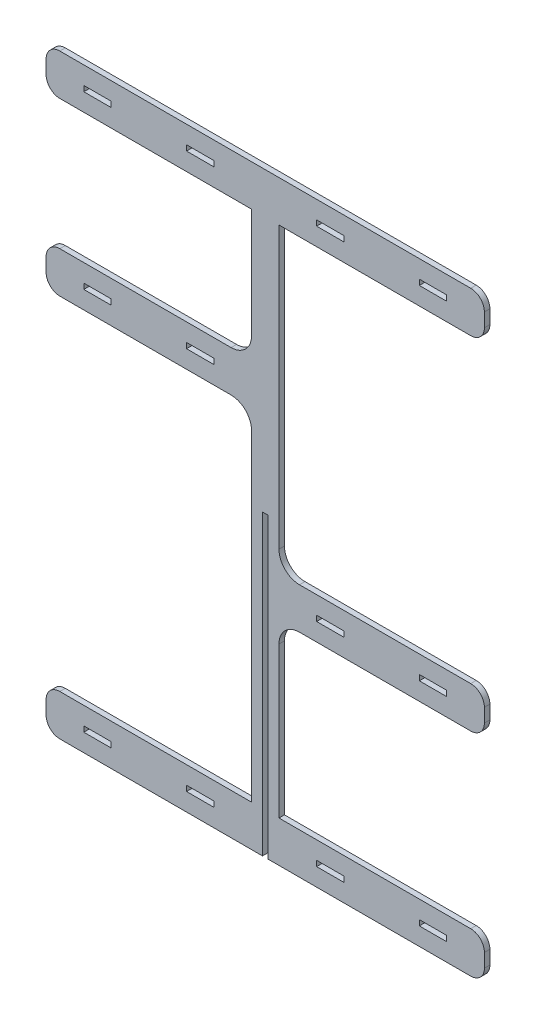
ISO-10303-21;
HEADER;
FILE_DESCRIPTION(('STEP AP214'),'2;1');
FILE_NAME('part.step','',(''),(''),'','','');
FILE_SCHEMA(('AUTOMOTIVE_DESIGN { 1 0 10303 214 1 1 1 1 }'));
ENDSEC;
DATA;
#1=APPLICATION_CONTEXT('core data for automotive mechanical design processes');
#2=APPLICATION_PROTOCOL_DEFINITION('international standard','automotive_design',2000,#1);
#3=PRODUCT_CONTEXT('',#1,'mechanical');
#4=PRODUCT('Part','Part','',(#3));
#5=PRODUCT_RELATED_PRODUCT_CATEGORY('part','',(#4));
#6=PRODUCT_DEFINITION_FORMATION('','',#4);
#7=PRODUCT_DEFINITION_CONTEXT('part definition',#1,'design');
#8=PRODUCT_DEFINITION('design','',#6,#7);
#9=PRODUCT_DEFINITION_SHAPE('','',#8);
#10=(LENGTH_UNIT() NAMED_UNIT(*) SI_UNIT(.MILLI.,.METRE.));
#11=(NAMED_UNIT(*) PLANE_ANGLE_UNIT() SI_UNIT($,.RADIAN.));
#12=(NAMED_UNIT(*) SI_UNIT($,.STERADIAN.) SOLID_ANGLE_UNIT());
#13=UNCERTAINTY_MEASURE_WITH_UNIT(LENGTH_MEASURE(1.E-05),#10,'distance_accuracy_value','');
#14=(GEOMETRIC_REPRESENTATION_CONTEXT(3) GLOBAL_UNCERTAINTY_ASSIGNED_CONTEXT((#13)) GLOBAL_UNIT_ASSIGNED_CONTEXT((#10,
#11,#12)) REPRESENTATION_CONTEXT('',''));
#15=CARTESIAN_POINT('',(0.,0.,0.));
#16=DIRECTION('',(0.,0.,1.));
#17=DIRECTION('',(1.,0.,0.));
#18=AXIS2_PLACEMENT_3D('',#15,#16,#17);
#19=CARTESIAN_POINT('',(320.,0.,2.));
#20=DIRECTION('',(0.,1.,0.));
#21=DIRECTION('',(0.,0.,1.));
#22=AXIS2_PLACEMENT_3D('',#19,#20,#21);
#23=PLANE('',#22);
#24=DIRECTION('',(1.,0.,0.));
#25=VECTOR('',#24,1.);
#26=CARTESIAN_POINT('',(320.,0.,-2.));
#27=LINE('',#26,#25);
#28=CARTESIAN_POINT('',(10.,0.,-2.));
#29=VERTEX_POINT('',#28);
#30=CARTESIAN_POINT('',(158.,0.,-2.));
#31=VERTEX_POINT('',#30);
#32=EDGE_CURVE('E602',#29,#31,#27,.T.);
#33=ORIENTED_EDGE('',*,*,#32,.T.);
#34=DIRECTION('',(0.,0.,1.));
#35=VECTOR('',#34,1.);
#36=CARTESIAN_POINT('',(158.,0.,-2.));
#37=LINE('',#36,#35);
#38=CARTESIAN_POINT('',(158.,0.,2.));
#39=VERTEX_POINT('',#38);
#40=EDGE_CURVE('E587',#31,#39,#37,.T.);
#41=ORIENTED_EDGE('',*,*,#40,.T.);
#42=DIRECTION('',(1.,0.,0.));
#43=VECTOR('',#42,1.);
#44=CARTESIAN_POINT('',(320.,0.,2.));
#45=LINE('',#44,#43);
#46=CARTESIAN_POINT('',(10.,0.,2.));
#47=VERTEX_POINT('',#46);
#48=EDGE_CURVE('E599',#47,#39,#45,.T.);
#49=ORIENTED_EDGE('',*,*,#48,.F.);
#50=DIRECTION('',(0.,0.,-1.));
#51=VECTOR('',#50,1.);
#52=CARTESIAN_POINT('',(10.,0.,2.));
#53=LINE('',#52,#51);
#54=EDGE_CURVE('E686',#47,#29,#53,.T.);
#55=ORIENTED_EDGE('',*,*,#54,.T.);
#56=EDGE_LOOP('',(#33,#41,#49,#55));
#57=FACE_BOUND('',#56,.T.);
#58=ADVANCED_FACE('F39',(#57),#23,.F.);
#59=CARTESIAN_POINT('',(170.,200.,2.));
#60=DIRECTION('',(-1.,0.,0.));
#61=DIRECTION('',(0.,-1.,0.));
#62=AXIS2_PLACEMENT_3D('',#59,#60,#61);
#63=PLANE('',#62);
#64=DIRECTION('',(0.,0.,-1.));
#65=VECTOR('',#64,1.);
#66=CARTESIAN_POINT('',(170.,405.,2.));
#67=LINE('',#66,#65);
#68=CARTESIAN_POINT('',(170.,405.,2.));
#69=VERTEX_POINT('',#68);
#70=CARTESIAN_POINT('',(170.,405.,-2.));
#71=VERTEX_POINT('',#70);
#72=EDGE_CURVE('E769',#69,#71,#67,.T.);
#73=ORIENTED_EDGE('',*,*,#72,.F.);
#74=DIRECTION('',(0.,1.,0.));
#75=VECTOR('',#74,1.);
#76=CARTESIAN_POINT('',(170.,200.,2.));
#77=LINE('',#76,#75);
#78=CARTESIAN_POINT('',(170.,200.,2.));
#79=VERTEX_POINT('',#78);
#80=EDGE_CURVE('E911',#79,#69,#77,.T.);
#81=ORIENTED_EDGE('',*,*,#80,.F.);
#82=DIRECTION('',(0.,0.,-1.));
#83=VECTOR('',#82,1.);
#84=CARTESIAN_POINT('',(170.,200.,2.));
#85=LINE('',#84,#83);
#86=CARTESIAN_POINT('',(170.,200.,-2.));
#87=VERTEX_POINT('',#86);
#88=EDGE_CURVE('E981',#79,#87,#85,.T.);
#89=ORIENTED_EDGE('',*,*,#88,.T.);
#90=DIRECTION('',(0.,1.,0.));
#91=VECTOR('',#90,1.);
#92=CARTESIAN_POINT('',(170.,200.,-2.));
#93=LINE('',#92,#91);
#94=EDGE_CURVE('E947',#87,#71,#93,.T.);
#95=ORIENTED_EDGE('',*,*,#94,.T.);
#96=EDGE_LOOP('',(#73,#81,#89,#95));
#97=FACE_BOUND('',#96,.T.);
#98=ADVANCED_FACE('F1187',(#97),#63,.F.);
#99=CARTESIAN_POINT('',(150.,435.,2.));
#100=DIRECTION('',(1.,0.,0.));
#101=DIRECTION('',(0.,1.,0.));
#102=AXIS2_PLACEMENT_3D('',#99,#100,#101);
#103=PLANE('',#102);
#104=DIRECTION('',(0.,0.,1.));
#105=VECTOR('',#104,1.);
#106=CARTESIAN_POINT('',(150.,405.,2.));
#107=LINE('',#106,#105);
#108=CARTESIAN_POINT('',(150.,405.,-2.));
#109=VERTEX_POINT('',#108);
#110=CARTESIAN_POINT('',(150.,405.,2.));
#111=VERTEX_POINT('',#110);
#112=EDGE_CURVE('E708',#109,#111,#107,.T.);
#113=ORIENTED_EDGE('',*,*,#112,.F.);
#114=DIRECTION('',(0.,-1.,0.));
#115=VECTOR('',#114,1.);
#116=CARTESIAN_POINT('',(150.,435.,-2.));
#117=LINE('',#116,#115);
#118=CARTESIAN_POINT('',(150.,325.,-2.));
#119=VERTEX_POINT('',#118);
#120=EDGE_CURVE('E952',#109,#119,#117,.T.);
#121=ORIENTED_EDGE('',*,*,#120,.T.);
#122=DIRECTION('',(0.,0.,-1.));
#123=VECTOR('',#122,1.);
#124=CARTESIAN_POINT('',(150.,325.,2.));
#125=LINE('',#124,#123);
#126=CARTESIAN_POINT('',(150.,325.,2.));
#127=VERTEX_POINT('',#126);
#128=EDGE_CURVE('E978',#127,#119,#125,.T.);
#129=ORIENTED_EDGE('',*,*,#128,.F.);
#130=DIRECTION('',(0.,-1.,0.));
#131=VECTOR('',#130,1.);
#132=CARTESIAN_POINT('',(150.,435.,2.));
#133=LINE('',#132,#131);
#134=EDGE_CURVE('E917',#111,#127,#133,.T.);
#135=ORIENTED_EDGE('',*,*,#134,.F.);
#136=EDGE_LOOP('',(#113,#121,#129,#135));
#137=FACE_BOUND('',#136,.T.);
#138=ADVANCED_FACE('F1367',(#137),#103,.F.);
#139=CARTESIAN_POINT('',(0.,30.,2.));
#140=DIRECTION('',(0.,-1.,0.));
#141=DIRECTION('',(0.,0.,-1.));
#142=AXIS2_PLACEMENT_3D('',#139,#140,#141);
#143=PLANE('',#142);
#144=DIRECTION('',(-1.,0.,0.));
#145=VECTOR('',#144,1.);
#146=CARTESIAN_POINT('',(0.,30.,2.));
#147=LINE('',#146,#145);
#148=CARTESIAN_POINT('',(310.,30.,2.));
#149=VERTEX_POINT('',#148);
#150=CARTESIAN_POINT('',(170.,30.,2.));
#151=VERTEX_POINT('',#150);
#152=EDGE_CURVE('E622',#149,#151,#147,.T.);
#153=ORIENTED_EDGE('',*,*,#152,.F.);
#154=DIRECTION('',(0.,0.,-1.));
#155=VECTOR('',#154,1.);
#156=CARTESIAN_POINT('',(310.,30.,2.));
#157=LINE('',#156,#155);
#158=CARTESIAN_POINT('',(310.,30.,-2.));
#159=VERTEX_POINT('',#158);
#160=EDGE_CURVE('E698',#149,#159,#157,.T.);
#161=ORIENTED_EDGE('',*,*,#160,.T.);
#162=DIRECTION('',(-1.,0.,0.));
#163=VECTOR('',#162,1.);
#164=CARTESIAN_POINT('',(0.,30.,-2.));
#165=LINE('',#164,#163);
#166=CARTESIAN_POINT('',(170.,30.,-2.));
#167=VERTEX_POINT('',#166);
#168=EDGE_CURVE('E633',#159,#167,#165,.T.);
#169=ORIENTED_EDGE('',*,*,#168,.T.);
#170=DIRECTION('',(0.,0.,-1.));
#171=VECTOR('',#170,1.);
#172=CARTESIAN_POINT('',(170.,30.,2.));
#173=LINE('',#172,#171);
#174=EDGE_CURVE('E993',#151,#167,#173,.T.);
#175=ORIENTED_EDGE('',*,*,#174,.F.);
#176=EDGE_LOOP('',(#153,#161,#169,#175));
#177=FACE_BOUND('',#176,.T.);
#178=ADVANCED_FACE('F1144',(#177),#143,.F.);
#179=CARTESIAN_POINT('',(0.,0.,2.));
#180=DIRECTION('',(0.,0.,-1.));
#181=DIRECTION('',(-1.,0.,0.));
#182=AXIS2_PLACEMENT_3D('',#179,#180,#181);
#183=PLANE('',#182);
#184=ORIENTED_EDGE('',*,*,#48,.T.);
#185=DIRECTION('',(0.,-1.,0.));
#186=VECTOR('',#185,1.);
#187=CARTESIAN_POINT('',(158.,0.,2.));
#188=LINE('',#187,#186);
#189=CARTESIAN_POINT('',(158.,217.5,2.));
#190=VERTEX_POINT('',#189);
#191=EDGE_CURVE('E583',#190,#39,#188,.T.);
#192=ORIENTED_EDGE('',*,*,#191,.F.);
#193=DIRECTION('',(-1.,0.,0.));
#194=VECTOR('',#193,1.);
#195=CARTESIAN_POINT('',(158.,217.5,2.));
#196=LINE('',#195,#194);
#197=CARTESIAN_POINT('',(162.,217.5,2.));
#198=VERTEX_POINT('',#197);
#199=EDGE_CURVE('E1334',#198,#190,#196,.T.);
#200=ORIENTED_EDGE('',*,*,#199,.F.);
#201=DIRECTION('',(0.,1.,0.));
#202=VECTOR('',#201,1.);
#203=CARTESIAN_POINT('',(162.,0.,2.));
#204=LINE('',#203,#202);
#205=CARTESIAN_POINT('',(162.,0.,2.));
#206=VERTEX_POINT('',#205);
#207=EDGE_CURVE('E593',#206,#198,#204,.T.);
#208=ORIENTED_EDGE('',*,*,#207,.F.);
#209=CARTESIAN_POINT('',(310.,0.,2.));
#210=VERTEX_POINT('',#209);
#211=EDGE_CURVE('E612',#206,#210,#45,.T.);
#212=ORIENTED_EDGE('',*,*,#211,.T.);
#213=CARTESIAN_POINT('',(310.,10.,2.));
#214=DIRECTION('',(0.,0.,-1.));
#215=DIRECTION('',(-1.,0.,0.));
#216=AXIS2_PLACEMENT_3D('',#213,#214,#215);
#217=CIRCLE('',#216,10.);
#218=CARTESIAN_POINT('',(320.,9.99999999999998,2.));
#219=VERTEX_POINT('',#218);
#220=EDGE_CURVE('E696',#210,#219,#217,.F.);
#221=ORIENTED_EDGE('',*,*,#220,.T.);
#222=DIRECTION('',(0.,1.,0.));
#223=VECTOR('',#222,1.);
#224=CARTESIAN_POINT('',(320.,30.,2.));
#225=LINE('',#224,#223);
#226=CARTESIAN_POINT('',(320.,20.,2.));
#227=VERTEX_POINT('',#226);
#228=EDGE_CURVE('E611',#219,#227,#225,.T.);
#229=ORIENTED_EDGE('',*,*,#228,.T.);
#230=CARTESIAN_POINT('',(310.,20.,2.));
#231=DIRECTION('',(0.,0.,-1.));
#232=DIRECTION('',(-1.,0.,0.));
#233=AXIS2_PLACEMENT_3D('',#230,#231,#232);
#234=CIRCLE('',#233,10.);
#235=EDGE_CURVE('E694',#227,#149,#234,.F.);
#236=ORIENTED_EDGE('',*,*,#235,.T.);
#237=ORIENTED_EDGE('',*,*,#152,.T.);
#238=DIRECTION('',(0.,1.,0.));
#239=VECTOR('',#238,1.);
#240=CARTESIAN_POINT('',(170.,30.,2.));
#241=LINE('',#240,#239);
#242=CARTESIAN_POINT('',(170.,140.,2.));
#243=VERTEX_POINT('',#242);
#244=EDGE_CURVE('E896',#151,#243,#241,.T.);
#245=ORIENTED_EDGE('',*,*,#244,.T.);
#246=CARTESIAN_POINT('',(185.,140.,2.));
#247=DIRECTION('',(0.,0.,-1.));
#248=DIRECTION('',(-1.,0.,0.));
#249=AXIS2_PLACEMENT_3D('',#246,#247,#248);
#250=CIRCLE('',#249,15.);
#251=CARTESIAN_POINT('',(185.,155.,2.));
#252=VERTEX_POINT('',#251);
#253=EDGE_CURVE('E898',#243,#252,#250,.T.);
#254=ORIENTED_EDGE('',*,*,#253,.T.);
#255=DIRECTION('',(1.,0.,0.));
#256=VECTOR('',#255,1.);
#257=CARTESIAN_POINT('',(185.,155.,2.));
#258=LINE('',#257,#256);
#259=CARTESIAN_POINT('',(310.,155.,2.));
#260=VERTEX_POINT('',#259);
#261=EDGE_CURVE('E901',#252,#260,#258,.T.);
#262=ORIENTED_EDGE('',*,*,#261,.T.);
#263=CARTESIAN_POINT('',(310.,165.,2.));
#264=DIRECTION('',(0.,0.,-1.));
#265=DIRECTION('',(-1.,0.,0.));
#266=AXIS2_PLACEMENT_3D('',#263,#264,#265);
#267=CIRCLE('',#266,10.);
#268=CARTESIAN_POINT('',(320.,165.,2.));
#269=VERTEX_POINT('',#268);
#270=EDGE_CURVE('E657',#260,#269,#267,.F.);
#271=ORIENTED_EDGE('',*,*,#270,.T.);
#272=DIRECTION('',(0.,1.,0.));
#273=VECTOR('',#272,1.);
#274=CARTESIAN_POINT('',(320.,155.,2.));
#275=LINE('',#274,#273);
#276=CARTESIAN_POINT('',(320.,175.,2.));
#277=VERTEX_POINT('',#276);
#278=EDGE_CURVE('E904',#269,#277,#275,.T.);
#279=ORIENTED_EDGE('',*,*,#278,.T.);
#280=CARTESIAN_POINT('',(310.,175.,2.));
#281=DIRECTION('',(0.,0.,-1.));
#282=DIRECTION('',(-1.,0.,0.));
#283=AXIS2_PLACEMENT_3D('',#280,#281,#282);
#284=CIRCLE('',#283,10.);
#285=CARTESIAN_POINT('',(310.,185.,2.));
#286=VERTEX_POINT('',#285);
#287=EDGE_CURVE('E655',#277,#286,#284,.F.);
#288=ORIENTED_EDGE('',*,*,#287,.T.);
#289=DIRECTION('',(-1.,0.,0.));
#290=VECTOR('',#289,1.);
#291=CARTESIAN_POINT('',(320.,185.,2.));
#292=LINE('',#291,#290);
#293=CARTESIAN_POINT('',(185.,185.,2.));
#294=VERTEX_POINT('',#293);
#295=EDGE_CURVE('E907',#286,#294,#292,.T.);
#296=ORIENTED_EDGE('',*,*,#295,.T.);
#297=CARTESIAN_POINT('',(185.,200.,2.));
#298=DIRECTION('',(0.,0.,-1.));
#299=DIRECTION('',(-1.,0.,0.));
#300=AXIS2_PLACEMENT_3D('',#297,#298,#299);
#301=CIRCLE('',#300,15.);
#302=EDGE_CURVE('E909',#294,#79,#301,.T.);
#303=ORIENTED_EDGE('',*,*,#302,.T.);
#304=ORIENTED_EDGE('',*,*,#80,.T.);
#305=DIRECTION('',(1.,0.,0.));
#306=VECTOR('',#305,1.);
#307=CARTESIAN_POINT('',(320.,405.,2.));
#308=LINE('',#307,#306);
#309=CARTESIAN_POINT('',(310.,405.,2.));
#310=VERTEX_POINT('',#309);
#311=EDGE_CURVE('E758',#69,#310,#308,.T.);
#312=ORIENTED_EDGE('',*,*,#311,.T.);
#313=CARTESIAN_POINT('',(310.,415.,2.));
#314=DIRECTION('',(0.,0.,-1.));
#315=DIRECTION('',(-1.,0.,0.));
#316=AXIS2_PLACEMENT_3D('',#313,#314,#315);
#317=CIRCLE('',#316,10.);
#318=CARTESIAN_POINT('',(320.,415.,2.));
#319=VERTEX_POINT('',#318);
#320=EDGE_CURVE('E731',#310,#319,#317,.F.);
#321=ORIENTED_EDGE('',*,*,#320,.T.);
#322=DIRECTION('',(0.,1.,0.));
#323=VECTOR('',#322,1.);
#324=CARTESIAN_POINT('',(320.,435.,2.));
#325=LINE('',#324,#323);
#326=CARTESIAN_POINT('',(320.,425.,2.));
#327=VERTEX_POINT('',#326);
#328=EDGE_CURVE('E1202',#319,#327,#325,.T.);
#329=ORIENTED_EDGE('',*,*,#328,.T.);
#330=CARTESIAN_POINT('',(310.,425.,2.));
#331=DIRECTION('',(0.,0.,-1.));
#332=DIRECTION('',(-1.,0.,0.));
#333=AXIS2_PLACEMENT_3D('',#330,#331,#332);
#334=CIRCLE('',#333,10.);
#335=CARTESIAN_POINT('',(310.,435.,2.));
#336=VERTEX_POINT('',#335);
#337=EDGE_CURVE('E729',#327,#336,#334,.F.);
#338=ORIENTED_EDGE('',*,*,#337,.T.);
#339=DIRECTION('',(-1.,0.,0.));
#340=VECTOR('',#339,1.);
#341=CARTESIAN_POINT('',(170.,435.,2.));
#342=LINE('',#341,#340);
#343=CARTESIAN_POINT('',(10.,435.,2.));
#344=VERTEX_POINT('',#343);
#345=EDGE_CURVE('E914',#336,#344,#342,.T.);
#346=ORIENTED_EDGE('',*,*,#345,.T.);
#347=CARTESIAN_POINT('',(10.,425.,2.));
#348=DIRECTION('',(0.,0.,-1.));
#349=DIRECTION('',(-1.,0.,0.));
#350=AXIS2_PLACEMENT_3D('',#347,#348,#349);
#351=CIRCLE('',#350,10.);
#352=CARTESIAN_POINT('',(0.,425.,2.));
#353=VERTEX_POINT('',#352);
#354=EDGE_CURVE('E726',#344,#353,#351,.F.);
#355=ORIENTED_EDGE('',*,*,#354,.T.);
#356=DIRECTION('',(0.,-1.,0.));
#357=VECTOR('',#356,1.);
#358=CARTESIAN_POINT('',(0.,405.,2.));
#359=LINE('',#358,#357);
#360=CARTESIAN_POINT('',(0.,415.,2.));
#361=VERTEX_POINT('',#360);
#362=EDGE_CURVE('E749',#353,#361,#359,.T.);
#363=ORIENTED_EDGE('',*,*,#362,.T.);
#364=CARTESIAN_POINT('',(10.0000000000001,415.,2.));
#365=DIRECTION('',(0.,0.,-1.));
#366=DIRECTION('',(-1.,0.,0.));
#367=AXIS2_PLACEMENT_3D('',#364,#365,#366);
#368=CIRCLE('',#367,10.);
#369=CARTESIAN_POINT('',(10.0000000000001,405.,2.));
#370=VERTEX_POINT('',#369);
#371=EDGE_CURVE('E62',#361,#370,#368,.F.);
#372=ORIENTED_EDGE('',*,*,#371,.T.);
#373=EDGE_CURVE('E762',#370,#111,#308,.T.);
#374=ORIENTED_EDGE('',*,*,#373,.T.);
#375=ORIENTED_EDGE('',*,*,#134,.T.);
#376=CARTESIAN_POINT('',(135.,325.,2.));
#377=DIRECTION('',(0.,0.,-1.));
#378=DIRECTION('',(-1.,0.,0.));
#379=AXIS2_PLACEMENT_3D('',#376,#377,#378);
#380=CIRCLE('',#379,15.);
#381=CARTESIAN_POINT('',(135.,310.,2.));
#382=VERTEX_POINT('',#381);
#383=EDGE_CURVE('E919',#127,#382,#380,.T.);
#384=ORIENTED_EDGE('',*,*,#383,.T.);
#385=DIRECTION('',(-1.,0.,0.));
#386=VECTOR('',#385,1.);
#387=CARTESIAN_POINT('',(135.,310.,2.));
#388=LINE('',#387,#386);
#389=CARTESIAN_POINT('',(9.99999999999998,310.,2.));
#390=VERTEX_POINT('',#389);
#391=EDGE_CURVE('E921',#382,#390,#388,.T.);
#392=ORIENTED_EDGE('',*,*,#391,.T.);
#393=CARTESIAN_POINT('',(9.99999999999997,300.,2.));
#394=DIRECTION('',(0.,0.,-1.));
#395=DIRECTION('',(-1.,0.,0.));
#396=AXIS2_PLACEMENT_3D('',#393,#394,#395);
#397=CIRCLE('',#396,10.);
#398=CARTESIAN_POINT('',(0.,300.,2.));
#399=VERTEX_POINT('',#398);
#400=EDGE_CURVE('E651',#390,#399,#397,.F.);
#401=ORIENTED_EDGE('',*,*,#400,.T.);
#402=DIRECTION('',(0.,-1.,0.));
#403=VECTOR('',#402,1.);
#404=CARTESIAN_POINT('',(0.,310.,2.));
#405=LINE('',#404,#403);
#406=CARTESIAN_POINT('',(0.,290.,2.));
#407=VERTEX_POINT('',#406);
#408=EDGE_CURVE('E924',#399,#407,#405,.T.);
#409=ORIENTED_EDGE('',*,*,#408,.T.);
#410=CARTESIAN_POINT('',(9.99999999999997,290.,2.));
#411=DIRECTION('',(0.,0.,-1.));
#412=DIRECTION('',(-1.,0.,0.));
#413=AXIS2_PLACEMENT_3D('',#410,#411,#412);
#414=CIRCLE('',#413,10.);
#415=CARTESIAN_POINT('',(9.99999999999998,280.,2.));
#416=VERTEX_POINT('',#415);
#417=EDGE_CURVE('E653',#407,#416,#414,.F.);
#418=ORIENTED_EDGE('',*,*,#417,.T.);
#419=DIRECTION('',(1.,0.,0.));
#420=VECTOR('',#419,1.);
#421=CARTESIAN_POINT('',(0.,280.,2.));
#422=LINE('',#421,#420);
#423=CARTESIAN_POINT('',(135.,280.,2.));
#424=VERTEX_POINT('',#423);
#425=EDGE_CURVE('E927',#416,#424,#422,.T.);
#426=ORIENTED_EDGE('',*,*,#425,.T.);
#427=CARTESIAN_POINT('',(135.,265.,2.));
#428=DIRECTION('',(0.,0.,-1.));
#429=DIRECTION('',(-1.,0.,0.));
#430=AXIS2_PLACEMENT_3D('',#427,#428,#429);
#431=CIRCLE('',#430,15.);
#432=CARTESIAN_POINT('',(150.,265.,2.));
#433=VERTEX_POINT('',#432);
#434=EDGE_CURVE('E929',#424,#433,#431,.T.);
#435=ORIENTED_EDGE('',*,*,#434,.T.);
#436=DIRECTION('',(0.,-1.,0.));
#437=VECTOR('',#436,1.);
#438=CARTESIAN_POINT('',(150.,265.,2.));
#439=LINE('',#438,#437);
#440=CARTESIAN_POINT('',(150.,30.,2.));
#441=VERTEX_POINT('',#440);
#442=EDGE_CURVE('E931',#433,#441,#439,.T.);
#443=ORIENTED_EDGE('',*,*,#442,.T.);
#444=CARTESIAN_POINT('',(10.,30.,2.));
#445=VERTEX_POINT('',#444);
#446=EDGE_CURVE('E615',#441,#445,#147,.T.);
#447=ORIENTED_EDGE('',*,*,#446,.T.);
#448=CARTESIAN_POINT('',(10.,20.,2.));
#449=DIRECTION('',(0.,0.,-1.));
#450=DIRECTION('',(-1.,0.,0.));
#451=AXIS2_PLACEMENT_3D('',#448,#449,#450);
#452=CIRCLE('',#451,10.);
#453=CARTESIAN_POINT('',(0.,20.,2.));
#454=VERTEX_POINT('',#453);
#455=EDGE_CURVE('E691',#445,#454,#452,.F.);
#456=ORIENTED_EDGE('',*,*,#455,.T.);
#457=DIRECTION('',(0.,-1.,0.));
#458=VECTOR('',#457,1.);
#459=CARTESIAN_POINT('',(0.,0.,2.));
#460=LINE('',#459,#458);
#461=CARTESIAN_POINT('',(0.,10.,2.));
#462=VERTEX_POINT('',#461);
#463=EDGE_CURVE('E624',#454,#462,#460,.T.);
#464=ORIENTED_EDGE('',*,*,#463,.T.);
#465=CARTESIAN_POINT('',(10.,10.,2.));
#466=DIRECTION('',(0.,0.,-1.));
#467=DIRECTION('',(-1.,0.,0.));
#468=AXIS2_PLACEMENT_3D('',#465,#466,#467);
#469=CIRCLE('',#468,10.);
#470=EDGE_CURVE('E610',#462,#47,#469,.F.);
#471=ORIENTED_EDGE('',*,*,#470,.T.);
#472=EDGE_LOOP('',(#184,#192,#200,#208,#212,#221,#229,#236,#237,#245,#254,#262,#271,#279,#288,
#296,#303,#304,#312,#321,#329,#338,#346,#355,#363,#372,#374,#375,#384,#392,#401,#409,#418,#426,
#435,#443,#447,#456,#464,#471));
#473=FACE_BOUND('',#472,.T.);
#474=DIRECTION('',(0.,1.,0.));
#475=VECTOR('',#474,1.);
#476=CARTESIAN_POINT('',(122.5,418.,2.));
#477=LINE('',#476,#475);
#478=CARTESIAN_POINT('',(122.5,418.,2.));
#479=VERTEX_POINT('',#478);
#480=CARTESIAN_POINT('',(122.5,422.,2.));
#481=VERTEX_POINT('',#480);
#482=EDGE_CURVE('E1246',#479,#481,#477,.T.);
#483=ORIENTED_EDGE('',*,*,#482,.F.);
#484=DIRECTION('',(1.,0.,0.));
#485=VECTOR('',#484,1.);
#486=CARTESIAN_POINT('',(102.5,418.,2.));
#487=LINE('',#486,#485);
#488=CARTESIAN_POINT('',(102.5,418.,2.));
#489=VERTEX_POINT('',#488);
#490=EDGE_CURVE('E1242',#489,#479,#487,.T.);
#491=ORIENTED_EDGE('',*,*,#490,.F.);
#492=DIRECTION('',(0.,-1.,0.));
#493=VECTOR('',#492,1.);
#494=CARTESIAN_POINT('',(102.5,418.,2.));
#495=LINE('',#494,#493);
#496=CARTESIAN_POINT('',(102.5,422.,2.));
#497=VERTEX_POINT('',#496);
#498=EDGE_CURVE('E1258',#497,#489,#495,.T.);
#499=ORIENTED_EDGE('',*,*,#498,.F.);
#500=DIRECTION('',(-1.,0.,0.));
#501=VECTOR('',#500,1.);
#502=CARTESIAN_POINT('',(102.5,422.,2.));
#503=LINE('',#502,#501);
#504=EDGE_CURVE('E1261',#481,#497,#503,.T.);
#505=ORIENTED_EDGE('',*,*,#504,.F.);
#506=EDGE_LOOP('',(#483,#491,#499,#505));
#507=FACE_BOUND('',#506,.T.);
#508=DIRECTION('',(0.,1.,0.));
#509=VECTOR('',#508,1.);
#510=CARTESIAN_POINT('',(47.5,418.,2.));
#511=LINE('',#510,#509);
#512=CARTESIAN_POINT('',(47.5,418.,2.));
#513=VERTEX_POINT('',#512);
#514=CARTESIAN_POINT('',(47.5,422.,2.));
#515=VERTEX_POINT('',#514);
#516=EDGE_CURVE('E1215',#513,#515,#511,.T.);
#517=ORIENTED_EDGE('',*,*,#516,.F.);
#518=DIRECTION('',(1.,0.,0.));
#519=VECTOR('',#518,1.);
#520=CARTESIAN_POINT('',(27.5,418.,2.));
#521=LINE('',#520,#519);
#522=CARTESIAN_POINT('',(27.5,418.,2.));
#523=VERTEX_POINT('',#522);
#524=EDGE_CURVE('E1211',#523,#513,#521,.T.);
#525=ORIENTED_EDGE('',*,*,#524,.F.);
#526=DIRECTION('',(0.,-1.,0.));
#527=VECTOR('',#526,1.);
#528=CARTESIAN_POINT('',(27.5,418.,2.));
#529=LINE('',#528,#527);
#530=CARTESIAN_POINT('',(27.5,422.,2.));
#531=VERTEX_POINT('',#530);
#532=EDGE_CURVE('E1227',#531,#523,#529,.T.);
#533=ORIENTED_EDGE('',*,*,#532,.F.);
#534=DIRECTION('',(-1.,0.,0.));
#535=VECTOR('',#534,1.);
#536=CARTESIAN_POINT('',(27.5,422.,2.));
#537=LINE('',#536,#535);
#538=EDGE_CURVE('E1230',#515,#531,#537,.T.);
#539=ORIENTED_EDGE('',*,*,#538,.F.);
#540=EDGE_LOOP('',(#517,#525,#533,#539));
#541=FACE_BOUND('',#540,.T.);
#542=DIRECTION('',(0.,1.,0.));
#543=VECTOR('',#542,1.);
#544=CARTESIAN_POINT('',(217.5,418.,2.));
#545=LINE('',#544,#543);
#546=CARTESIAN_POINT('',(217.5,418.,2.));
#547=VERTEX_POINT('',#546);
#548=CARTESIAN_POINT('',(217.5,422.,2.));
#549=VERTEX_POINT('',#548);
#550=EDGE_CURVE('E1277',#547,#549,#545,.T.);
#551=ORIENTED_EDGE('',*,*,#550,.F.);
#552=DIRECTION('',(1.,0.,0.));
#553=VECTOR('',#552,1.);
#554=CARTESIAN_POINT('',(217.5,418.,2.));
#555=LINE('',#554,#553);
#556=CARTESIAN_POINT('',(197.5,418.,2.));
#557=VERTEX_POINT('',#556);
#558=EDGE_CURVE('E1273',#557,#547,#555,.T.);
#559=ORIENTED_EDGE('',*,*,#558,.F.);
#560=DIRECTION('',(0.,-1.,0.));
#561=VECTOR('',#560,1.);
#562=CARTESIAN_POINT('',(197.5,418.,2.));
#563=LINE('',#562,#561);
#564=CARTESIAN_POINT('',(197.5,422.,2.));
#565=VERTEX_POINT('',#564);
#566=EDGE_CURVE('E1289',#565,#557,#563,.T.);
#567=ORIENTED_EDGE('',*,*,#566,.F.);
#568=DIRECTION('',(-1.,0.,0.));
#569=VECTOR('',#568,1.);
#570=CARTESIAN_POINT('',(217.5,422.,2.));
#571=LINE('',#570,#569);
#572=EDGE_CURVE('E1292',#549,#565,#571,.T.);
#573=ORIENTED_EDGE('',*,*,#572,.F.);
#574=EDGE_LOOP('',(#551,#559,#567,#573));
#575=FACE_BOUND('',#574,.T.);
#576=DIRECTION('',(0.,1.,0.));
#577=VECTOR('',#576,1.);
#578=CARTESIAN_POINT('',(292.5,418.,2.));
#579=LINE('',#578,#577);
#580=CARTESIAN_POINT('',(292.5,418.,2.));
#581=VERTEX_POINT('',#580);
#582=CARTESIAN_POINT('',(292.5,422.,2.));
#583=VERTEX_POINT('',#582);
#584=EDGE_CURVE('E1308',#581,#583,#579,.T.);
#585=ORIENTED_EDGE('',*,*,#584,.F.);
#586=DIRECTION('',(1.,0.,0.));
#587=VECTOR('',#586,1.);
#588=CARTESIAN_POINT('',(292.5,418.,2.));
#589=LINE('',#588,#587);
#590=CARTESIAN_POINT('',(272.5,418.,2.));
#591=VERTEX_POINT('',#590);
#592=EDGE_CURVE('E1304',#591,#581,#589,.T.);
#593=ORIENTED_EDGE('',*,*,#592,.F.);
#594=DIRECTION('',(0.,-1.,0.));
#595=VECTOR('',#594,1.);
#596=CARTESIAN_POINT('',(272.5,418.,2.));
#597=LINE('',#596,#595);
#598=CARTESIAN_POINT('',(272.5,422.,2.));
#599=VERTEX_POINT('',#598);
#600=EDGE_CURVE('E1319',#599,#591,#597,.T.);
#601=ORIENTED_EDGE('',*,*,#600,.F.);
#602=DIRECTION('',(-1.,0.,0.));
#603=VECTOR('',#602,1.);
#604=CARTESIAN_POINT('',(292.5,422.,2.));
#605=LINE('',#604,#603);
#606=EDGE_CURVE('E1322',#583,#599,#605,.T.);
#607=ORIENTED_EDGE('',*,*,#606,.F.);
#608=EDGE_LOOP('',(#585,#593,#601,#607));
#609=FACE_BOUND('',#608,.T.);
#610=DIRECTION('',(0.,1.,0.));
#611=VECTOR('',#610,1.);
#612=CARTESIAN_POINT('',(217.5,168.,2.));
#613=LINE('',#612,#611);
#614=CARTESIAN_POINT('',(217.5,168.,2.));
#615=VERTEX_POINT('',#614);
#616=CARTESIAN_POINT('',(217.5,172.,2.));
#617=VERTEX_POINT('',#616);
#618=EDGE_CURVE('E772',#615,#617,#613,.T.);
#619=ORIENTED_EDGE('',*,*,#618,.F.);
#620=DIRECTION('',(1.,0.,0.));
#621=VECTOR('',#620,1.);
#622=CARTESIAN_POINT('',(197.5,168.,2.));
#623=LINE('',#622,#621);
#624=CARTESIAN_POINT('',(197.5,168.,2.));
#625=VERTEX_POINT('',#624);
#626=EDGE_CURVE('E780',#625,#615,#623,.T.);
#627=ORIENTED_EDGE('',*,*,#626,.F.);
#628=DIRECTION('',(0.,-1.,0.));
#629=VECTOR('',#628,1.);
#630=CARTESIAN_POINT('',(197.5,168.,2.));
#631=LINE('',#630,#629);
#632=CARTESIAN_POINT('',(197.5,172.,2.));
#633=VERTEX_POINT('',#632);
#634=EDGE_CURVE('E777',#633,#625,#631,.T.);
#635=ORIENTED_EDGE('',*,*,#634,.F.);
#636=DIRECTION('',(-1.,0.,0.));
#637=VECTOR('',#636,1.);
#638=CARTESIAN_POINT('',(197.5,172.,2.));
#639=LINE('',#638,#637);
#640=EDGE_CURVE('E774',#617,#633,#639,.T.);
#641=ORIENTED_EDGE('',*,*,#640,.F.);
#642=EDGE_LOOP('',(#619,#627,#635,#641));
#643=FACE_BOUND('',#642,.T.);
#644=DIRECTION('',(0.,1.,0.));
#645=VECTOR('',#644,1.);
#646=CARTESIAN_POINT('',(47.5,293.,2.));
#647=LINE('',#646,#645);
#648=CARTESIAN_POINT('',(47.5,293.,2.));
#649=VERTEX_POINT('',#648);
#650=CARTESIAN_POINT('',(47.5,297.,2.));
#651=VERTEX_POINT('',#650);
#652=EDGE_CURVE('E834',#649,#651,#647,.T.);
#653=ORIENTED_EDGE('',*,*,#652,.F.);
#654=DIRECTION('',(1.,0.,0.));
#655=VECTOR('',#654,1.);
#656=CARTESIAN_POINT('',(27.5,293.,2.));
#657=LINE('',#656,#655);
#658=CARTESIAN_POINT('',(27.5,293.,2.));
#659=VERTEX_POINT('',#658);
#660=EDGE_CURVE('E842',#659,#649,#657,.T.);
#661=ORIENTED_EDGE('',*,*,#660,.F.);
#662=DIRECTION('',(0.,-1.,0.));
#663=VECTOR('',#662,1.);
#664=CARTESIAN_POINT('',(27.5,293.,2.));
#665=LINE('',#664,#663);
#666=CARTESIAN_POINT('',(27.5,297.,2.));
#667=VERTEX_POINT('',#666);
#668=EDGE_CURVE('E839',#667,#659,#665,.T.);
#669=ORIENTED_EDGE('',*,*,#668,.F.);
#670=DIRECTION('',(-1.,0.,0.));
#671=VECTOR('',#670,1.);
#672=CARTESIAN_POINT('',(27.5,297.,2.));
#673=LINE('',#672,#671);
#674=EDGE_CURVE('E836',#651,#667,#673,.T.);
#675=ORIENTED_EDGE('',*,*,#674,.F.);
#676=EDGE_LOOP('',(#653,#661,#669,#675));
#677=FACE_BOUND('',#676,.T.);
#678=DIRECTION('',(-1.,0.,0.));
#679=VECTOR('',#678,1.);
#680=CARTESIAN_POINT('',(102.5,297.,2.));
#681=LINE('',#680,#679);
#682=CARTESIAN_POINT('',(122.5,297.,2.));
#683=VERTEX_POINT('',#682);
#684=CARTESIAN_POINT('',(102.5,297.,2.));
#685=VERTEX_POINT('',#684);
#686=EDGE_CURVE('E865',#683,#685,#681,.T.);
#687=ORIENTED_EDGE('',*,*,#686,.F.);
#688=DIRECTION('',(0.,1.,0.));
#689=VECTOR('',#688,1.);
#690=CARTESIAN_POINT('',(122.5,293.,2.));
#691=LINE('',#690,#689);
#692=CARTESIAN_POINT('',(122.5,293.,2.));
#693=VERTEX_POINT('',#692);
#694=EDGE_CURVE('E873',#693,#683,#691,.T.);
#695=ORIENTED_EDGE('',*,*,#694,.F.);
#696=DIRECTION('',(1.,0.,0.));
#697=VECTOR('',#696,1.);
#698=CARTESIAN_POINT('',(102.5,293.,2.));
#699=LINE('',#698,#697);
#700=CARTESIAN_POINT('',(102.5,293.,2.));
#701=VERTEX_POINT('',#700);
#702=EDGE_CURVE('E870',#701,#693,#699,.T.);
#703=ORIENTED_EDGE('',*,*,#702,.F.);
#704=DIRECTION('',(0.,-1.,0.));
#705=VECTOR('',#704,1.);
#706=CARTESIAN_POINT('',(102.5,293.,2.));
#707=LINE('',#706,#705);
#708=EDGE_CURVE('E867',#685,#701,#707,.T.);
#709=ORIENTED_EDGE('',*,*,#708,.F.);
#710=EDGE_LOOP('',(#687,#695,#703,#709));
#711=FACE_BOUND('',#710,.T.);
#712=DIRECTION('',(0.,1.,0.));
#713=VECTOR('',#712,1.);
#714=CARTESIAN_POINT('',(292.5,168.,2.));
#715=LINE('',#714,#713);
#716=CARTESIAN_POINT('',(292.5,168.,2.));
#717=VERTEX_POINT('',#716);
#718=CARTESIAN_POINT('',(292.5,172.,2.));
#719=VERTEX_POINT('',#718);
#720=EDGE_CURVE('E803',#717,#719,#715,.T.);
#721=ORIENTED_EDGE('',*,*,#720,.F.);
#722=DIRECTION('',(1.,0.,0.));
#723=VECTOR('',#722,1.);
#724=CARTESIAN_POINT('',(272.5,168.,2.));
#725=LINE('',#724,#723);
#726=CARTESIAN_POINT('',(272.5,168.,2.));
#727=VERTEX_POINT('',#726);
#728=EDGE_CURVE('E811',#727,#717,#725,.T.);
#729=ORIENTED_EDGE('',*,*,#728,.F.);
#730=DIRECTION('',(0.,-1.,0.));
#731=VECTOR('',#730,1.);
#732=CARTESIAN_POINT('',(272.5,168.,2.));
#733=LINE('',#732,#731);
#734=CARTESIAN_POINT('',(272.5,172.,2.));
#735=VERTEX_POINT('',#734);
#736=EDGE_CURVE('E808',#735,#727,#733,.T.);
#737=ORIENTED_EDGE('',*,*,#736,.F.);
#738=DIRECTION('',(-1.,0.,0.));
#739=VECTOR('',#738,1.);
#740=CARTESIAN_POINT('',(272.5,172.,2.));
#741=LINE('',#740,#739);
#742=EDGE_CURVE('E805',#719,#735,#741,.T.);
#743=ORIENTED_EDGE('',*,*,#742,.F.);
#744=EDGE_LOOP('',(#721,#729,#737,#743));
#745=FACE_BOUND('',#744,.T.);
#746=DIRECTION('',(0.,1.,0.));
#747=VECTOR('',#746,1.);
#748=CARTESIAN_POINT('',(292.5,13.,2.));
#749=LINE('',#748,#747);
#750=CARTESIAN_POINT('',(292.5,13.,2.));
#751=VERTEX_POINT('',#750);
#752=CARTESIAN_POINT('',(292.5,17.,2.));
#753=VERTEX_POINT('',#752);
#754=EDGE_CURVE('E997',#751,#753,#749,.T.);
#755=ORIENTED_EDGE('',*,*,#754,.F.);
#756=DIRECTION('',(1.,0.,0.));
#757=VECTOR('',#756,1.);
#758=CARTESIAN_POINT('',(292.5,13.,2.));
#759=LINE('',#758,#757);
#760=CARTESIAN_POINT('',(272.5,13.,2.));
#761=VERTEX_POINT('',#760);
#762=EDGE_CURVE('E1005',#761,#751,#759,.T.);
#763=ORIENTED_EDGE('',*,*,#762,.F.);
#764=DIRECTION('',(0.,-1.,0.));
#765=VECTOR('',#764,1.);
#766=CARTESIAN_POINT('',(272.5,13.,2.));
#767=LINE('',#766,#765);
#768=CARTESIAN_POINT('',(272.5,17.,2.));
#769=VERTEX_POINT('',#768);
#770=EDGE_CURVE('E1002',#769,#761,#767,.T.);
#771=ORIENTED_EDGE('',*,*,#770,.F.);
#772=DIRECTION('',(-1.,0.,0.));
#773=VECTOR('',#772,1.);
#774=CARTESIAN_POINT('',(292.5,17.,2.));
#775=LINE('',#774,#773);
#776=EDGE_CURVE('E999',#753,#769,#775,.T.);
#777=ORIENTED_EDGE('',*,*,#776,.F.);
#778=EDGE_LOOP('',(#755,#763,#771,#777));
#779=FACE_BOUND('',#778,.T.);
#780=DIRECTION('',(0.,1.,0.));
#781=VECTOR('',#780,1.);
#782=CARTESIAN_POINT('',(122.5,13.,2.));
#783=LINE('',#782,#781);
#784=CARTESIAN_POINT('',(122.5,13.,2.));
#785=VERTEX_POINT('',#784);
#786=CARTESIAN_POINT('',(122.5,17.,2.));
#787=VERTEX_POINT('',#786);
#788=EDGE_CURVE('E1059',#785,#787,#783,.T.);
#789=ORIENTED_EDGE('',*,*,#788,.F.);
#790=DIRECTION('',(1.,0.,0.));
#791=VECTOR('',#790,1.);
#792=CARTESIAN_POINT('',(102.5,13.,2.));
#793=LINE('',#792,#791);
#794=CARTESIAN_POINT('',(102.5,13.,2.));
#795=VERTEX_POINT('',#794);
#796=EDGE_CURVE('E1067',#795,#785,#793,.T.);
#797=ORIENTED_EDGE('',*,*,#796,.F.);
#798=DIRECTION('',(0.,-1.,0.));
#799=VECTOR('',#798,1.);
#800=CARTESIAN_POINT('',(102.5,13.,2.));
#801=LINE('',#800,#799);
#802=CARTESIAN_POINT('',(102.5,17.,2.));
#803=VERTEX_POINT('',#802);
#804=EDGE_CURVE('E1064',#803,#795,#801,.T.);
#805=ORIENTED_EDGE('',*,*,#804,.F.);
#806=DIRECTION('',(-1.,0.,0.));
#807=VECTOR('',#806,1.);
#808=CARTESIAN_POINT('',(102.5,17.,2.));
#809=LINE('',#808,#807);
#810=EDGE_CURVE('E1061',#787,#803,#809,.T.);
#811=ORIENTED_EDGE('',*,*,#810,.F.);
#812=EDGE_LOOP('',(#789,#797,#805,#811));
#813=FACE_BOUND('',#812,.T.);
#814=DIRECTION('',(0.,1.,0.));
#815=VECTOR('',#814,1.);
#816=CARTESIAN_POINT('',(47.5,13.,2.));
#817=LINE('',#816,#815);
#818=CARTESIAN_POINT('',(47.5,13.,2.));
#819=VERTEX_POINT('',#818);
#820=CARTESIAN_POINT('',(47.5,17.,2.));
#821=VERTEX_POINT('',#820);
#822=EDGE_CURVE('E1090',#819,#821,#817,.T.);
#823=ORIENTED_EDGE('',*,*,#822,.F.);
#824=DIRECTION('',(1.,0.,0.));
#825=VECTOR('',#824,1.);
#826=CARTESIAN_POINT('',(27.5,13.,2.));
#827=LINE('',#826,#825);
#828=CARTESIAN_POINT('',(27.5,13.,2.));
#829=VERTEX_POINT('',#828);
#830=EDGE_CURVE('E1098',#829,#819,#827,.T.);
#831=ORIENTED_EDGE('',*,*,#830,.F.);
#832=DIRECTION('',(0.,-1.,0.));
#833=VECTOR('',#832,1.);
#834=CARTESIAN_POINT('',(27.5,13.,2.));
#835=LINE('',#834,#833);
#836=CARTESIAN_POINT('',(27.5,17.,2.));
#837=VERTEX_POINT('',#836);
#838=EDGE_CURVE('E1095',#837,#829,#835,.T.);
#839=ORIENTED_EDGE('',*,*,#838,.F.);
#840=DIRECTION('',(-1.,0.,0.));
#841=VECTOR('',#840,1.);
#842=CARTESIAN_POINT('',(27.5,17.,2.));
#843=LINE('',#842,#841);
#844=EDGE_CURVE('E1092',#821,#837,#843,.T.);
#845=ORIENTED_EDGE('',*,*,#844,.F.);
#846=EDGE_LOOP('',(#823,#831,#839,#845));
#847=FACE_BOUND('',#846,.T.);
#848=DIRECTION('',(0.,1.,0.));
#849=VECTOR('',#848,1.);
#850=CARTESIAN_POINT('',(217.5,13.,2.));
#851=LINE('',#850,#849);
#852=CARTESIAN_POINT('',(217.5,13.,2.));
#853=VERTEX_POINT('',#852);
#854=CARTESIAN_POINT('',(217.5,17.,2.));
#855=VERTEX_POINT('',#854);
#856=EDGE_CURVE('E1028',#853,#855,#851,.T.);
#857=ORIENTED_EDGE('',*,*,#856,.F.);
#858=DIRECTION('',(1.,0.,0.));
#859=VECTOR('',#858,1.);
#860=CARTESIAN_POINT('',(217.5,13.,2.));
#861=LINE('',#860,#859);
#862=CARTESIAN_POINT('',(197.5,13.,2.));
#863=VERTEX_POINT('',#862);
#864=EDGE_CURVE('E1036',#863,#853,#861,.T.);
#865=ORIENTED_EDGE('',*,*,#864,.F.);
#866=DIRECTION('',(0.,-1.,0.));
#867=VECTOR('',#866,1.);
#868=CARTESIAN_POINT('',(197.5,13.,2.));
#869=LINE('',#868,#867);
#870=CARTESIAN_POINT('',(197.5,17.,2.));
#871=VERTEX_POINT('',#870);
#872=EDGE_CURVE('E1033',#871,#863,#869,.T.);
#873=ORIENTED_EDGE('',*,*,#872,.F.);
#874=DIRECTION('',(-1.,0.,0.));
#875=VECTOR('',#874,1.);
#876=CARTESIAN_POINT('',(217.5,17.,2.));
#877=LINE('',#876,#875);
#878=EDGE_CURVE('E1030',#855,#871,#877,.T.);
#879=ORIENTED_EDGE('',*,*,#878,.F.);
#880=EDGE_LOOP('',(#857,#865,#873,#879));
#881=FACE_BOUND('',#880,.T.);
#882=ADVANCED_FACE('F606',(#473,#507,#541,#575,#609,#643,#677,#711,#745,#779,#813,#847,#881),
#183,.F.);
#883=CARTESIAN_POINT('',(0.,0.,-2.));
#884=DIRECTION('',(0.,0.,-1.));
#885=DIRECTION('',(-1.,0.,0.));
#886=AXIS2_PLACEMENT_3D('',#883,#884,#885);
#887=PLANE('',#886);
#888=DIRECTION('',(0.,-1.,0.));
#889=VECTOR('',#888,1.);
#890=CARTESIAN_POINT('',(158.,0.,-2.));
#891=LINE('',#890,#889);
#892=CARTESIAN_POINT('',(158.,217.5,-2.));
#893=VERTEX_POINT('',#892);
#894=EDGE_CURVE('E1332',#893,#31,#891,.T.);
#895=ORIENTED_EDGE('',*,*,#894,.T.);
#896=ORIENTED_EDGE('',*,*,#32,.F.);
#897=CARTESIAN_POINT('',(10.,10.,-2.));
#898=DIRECTION('',(0.,0.,-1.));
#899=DIRECTION('',(-1.,0.,0.));
#900=AXIS2_PLACEMENT_3D('',#897,#898,#899);
#901=CIRCLE('',#900,10.);
#902=CARTESIAN_POINT('',(0.,10.,-2.));
#903=VERTEX_POINT('',#902);
#904=EDGE_CURVE('E679',#29,#903,#901,.T.);
#905=ORIENTED_EDGE('',*,*,#904,.T.);
#906=DIRECTION('',(0.,-1.,0.));
#907=VECTOR('',#906,1.);
#908=CARTESIAN_POINT('',(0.,0.,-2.));
#909=LINE('',#908,#907);
#910=CARTESIAN_POINT('',(0.,20.,-2.));
#911=VERTEX_POINT('',#910);
#912=EDGE_CURVE('E617',#911,#903,#909,.T.);
#913=ORIENTED_EDGE('',*,*,#912,.F.);
#914=CARTESIAN_POINT('',(10.,20.,-2.));
#915=DIRECTION('',(0.,0.,-1.));
#916=DIRECTION('',(-1.,0.,0.));
#917=AXIS2_PLACEMENT_3D('',#914,#915,#916);
#918=CIRCLE('',#917,10.);
#919=CARTESIAN_POINT('',(10.,30.,-2.));
#920=VERTEX_POINT('',#919);
#921=EDGE_CURVE('E677',#911,#920,#918,.T.);
#922=ORIENTED_EDGE('',*,*,#921,.T.);
#923=CARTESIAN_POINT('',(150.,30.,-2.));
#924=VERTEX_POINT('',#923);
#925=EDGE_CURVE('E632',#924,#920,#165,.T.);
#926=ORIENTED_EDGE('',*,*,#925,.F.);
#927=DIRECTION('',(0.,-1.,0.));
#928=VECTOR('',#927,1.);
#929=CARTESIAN_POINT('',(150.,265.,-2.));
#930=LINE('',#929,#928);
#931=CARTESIAN_POINT('',(150.,265.,-2.));
#932=VERTEX_POINT('',#931);
#933=EDGE_CURVE('E899',#932,#924,#930,.T.);
#934=ORIENTED_EDGE('',*,*,#933,.F.);
#935=CARTESIAN_POINT('',(135.,265.,-2.));
#936=DIRECTION('',(0.,0.,-1.));
#937=DIRECTION('',(-1.,0.,0.));
#938=AXIS2_PLACEMENT_3D('',#935,#936,#937);
#939=CIRCLE('',#938,15.);
#940=CARTESIAN_POINT('',(135.,280.,-2.));
#941=VERTEX_POINT('',#940);
#942=EDGE_CURVE('E964',#941,#932,#939,.T.);
#943=ORIENTED_EDGE('',*,*,#942,.F.);
#944=DIRECTION('',(1.,0.,0.));
#945=VECTOR('',#944,1.);
#946=CARTESIAN_POINT('',(0.,280.,-2.));
#947=LINE('',#946,#945);
#948=CARTESIAN_POINT('',(9.99999999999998,280.,-2.));
#949=VERTEX_POINT('',#948);
#950=EDGE_CURVE('E962',#949,#941,#947,.T.);
#951=ORIENTED_EDGE('',*,*,#950,.F.);
#952=CARTESIAN_POINT('',(9.99999999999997,290.,-2.));
#953=DIRECTION('',(0.,0.,-1.));
#954=DIRECTION('',(-1.,0.,0.));
#955=AXIS2_PLACEMENT_3D('',#952,#953,#954);
#956=CIRCLE('',#955,10.);
#957=CARTESIAN_POINT('',(0.,290.,-2.));
#958=VERTEX_POINT('',#957);
#959=EDGE_CURVE('E643',#949,#958,#956,.T.);
#960=ORIENTED_EDGE('',*,*,#959,.T.);
#961=DIRECTION('',(0.,-1.,0.));
#962=VECTOR('',#961,1.);
#963=CARTESIAN_POINT('',(0.,310.,-2.));
#964=LINE('',#963,#962);
#965=CARTESIAN_POINT('',(0.,300.,-2.));
#966=VERTEX_POINT('',#965);
#967=EDGE_CURVE('E959',#966,#958,#964,.T.);
#968=ORIENTED_EDGE('',*,*,#967,.F.);
#969=CARTESIAN_POINT('',(9.99999999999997,300.,-2.));
#970=DIRECTION('',(0.,0.,-1.));
#971=DIRECTION('',(-1.,0.,0.));
#972=AXIS2_PLACEMENT_3D('',#969,#970,#971);
#973=CIRCLE('',#972,10.);
#974=CARTESIAN_POINT('',(9.99999999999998,310.,-2.));
#975=VERTEX_POINT('',#974);
#976=EDGE_CURVE('E641',#966,#975,#973,.T.);
#977=ORIENTED_EDGE('',*,*,#976,.T.);
#978=DIRECTION('',(-1.,0.,0.));
#979=VECTOR('',#978,1.);
#980=CARTESIAN_POINT('',(135.,310.,-2.));
#981=LINE('',#980,#979);
#982=CARTESIAN_POINT('',(135.,310.,-2.));
#983=VERTEX_POINT('',#982);
#984=EDGE_CURVE('E956',#983,#975,#981,.T.);
#985=ORIENTED_EDGE('',*,*,#984,.F.);
#986=CARTESIAN_POINT('',(135.,325.,-2.));
#987=DIRECTION('',(0.,0.,-1.));
#988=DIRECTION('',(-1.,0.,0.));
#989=AXIS2_PLACEMENT_3D('',#986,#987,#988);
#990=CIRCLE('',#989,15.);
#991=EDGE_CURVE('E954',#119,#983,#990,.T.);
#992=ORIENTED_EDGE('',*,*,#991,.F.);
#993=ORIENTED_EDGE('',*,*,#120,.F.);
#994=DIRECTION('',(1.,0.,0.));
#995=VECTOR('',#994,1.);
#996=CARTESIAN_POINT('',(320.,405.,-2.));
#997=LINE('',#996,#995);
#998=CARTESIAN_POINT('',(10.0000000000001,405.,-2.));
#999=VERTEX_POINT('',#998);
#1000=EDGE_CURVE('E765',#999,#109,#997,.T.);
#1001=ORIENTED_EDGE('',*,*,#1000,.F.);
#1002=CARTESIAN_POINT('',(10.0000000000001,415.,-2.));
#1003=DIRECTION('',(0.,0.,-1.));
#1004=DIRECTION('',(-1.,0.,0.));
#1005=AXIS2_PLACEMENT_3D('',#1002,#1003,#1004);
#1006=CIRCLE('',#1005,10.);
#1007=CARTESIAN_POINT('',(0.,415.,-2.));
#1008=VERTEX_POINT('',#1007);
#1009=EDGE_CURVE('E718',#999,#1008,#1006,.T.);
#1010=ORIENTED_EDGE('',*,*,#1009,.T.);
#1011=DIRECTION('',(0.,-1.,0.));
#1012=VECTOR('',#1011,1.);
#1013=CARTESIAN_POINT('',(0.,405.,-2.));
#1014=LINE('',#1013,#1012);
#1015=CARTESIAN_POINT('',(0.,425.,-2.));
#1016=VERTEX_POINT('',#1015);
#1017=EDGE_CURVE('E747',#1016,#1008,#1014,.T.);
#1018=ORIENTED_EDGE('',*,*,#1017,.F.);
#1019=CARTESIAN_POINT('',(10.,425.,-2.));
#1020=DIRECTION('',(0.,0.,-1.));
#1021=DIRECTION('',(-1.,0.,0.));
#1022=AXIS2_PLACEMENT_3D('',#1019,#1020,#1021);
#1023=CIRCLE('',#1022,10.);
#1024=CARTESIAN_POINT('',(10.,435.,-2.));
#1025=VERTEX_POINT('',#1024);
#1026=EDGE_CURVE('E716',#1016,#1025,#1023,.T.);
#1027=ORIENTED_EDGE('',*,*,#1026,.T.);
#1028=DIRECTION('',(-1.,0.,0.));
#1029=VECTOR('',#1028,1.);
#1030=CARTESIAN_POINT('',(170.,435.,-2.));
#1031=LINE('',#1030,#1029);
#1032=CARTESIAN_POINT('',(310.,435.,-2.));
#1033=VERTEX_POINT('',#1032);
#1034=EDGE_CURVE('E950',#1033,#1025,#1031,.T.);
#1035=ORIENTED_EDGE('',*,*,#1034,.F.);
#1036=CARTESIAN_POINT('',(310.,425.,-2.));
#1037=DIRECTION('',(0.,0.,-1.));
#1038=DIRECTION('',(-1.,0.,0.));
#1039=AXIS2_PLACEMENT_3D('',#1036,#1037,#1038);
#1040=CIRCLE('',#1039,10.);
#1041=CARTESIAN_POINT('',(320.,425.,-2.));
#1042=VERTEX_POINT('',#1041);
#1043=EDGE_CURVE('E720',#1033,#1042,#1040,.T.);
#1044=ORIENTED_EDGE('',*,*,#1043,.T.);
#1045=DIRECTION('',(0.,1.,0.));
#1046=VECTOR('',#1045,1.);
#1047=CARTESIAN_POINT('',(320.,435.,-2.));
#1048=LINE('',#1047,#1046);
#1049=CARTESIAN_POINT('',(320.,415.,-2.));
#1050=VERTEX_POINT('',#1049);
#1051=EDGE_CURVE('E759',#1050,#1042,#1048,.T.);
#1052=ORIENTED_EDGE('',*,*,#1051,.F.);
#1053=CARTESIAN_POINT('',(310.,415.,-2.));
#1054=DIRECTION('',(0.,0.,-1.));
#1055=DIRECTION('',(-1.,0.,0.));
#1056=AXIS2_PLACEMENT_3D('',#1053,#1054,#1055);
#1057=CIRCLE('',#1056,10.);
#1058=CARTESIAN_POINT('',(310.,405.,-2.));
#1059=VERTEX_POINT('',#1058);
#1060=EDGE_CURVE('E722',#1050,#1059,#1057,.T.);
#1061=ORIENTED_EDGE('',*,*,#1060,.T.);
#1062=EDGE_CURVE('E1193',#71,#1059,#997,.T.);
#1063=ORIENTED_EDGE('',*,*,#1062,.F.);
#1064=ORIENTED_EDGE('',*,*,#94,.F.);
#1065=CARTESIAN_POINT('',(185.,200.,-2.));
#1066=DIRECTION('',(0.,0.,-1.));
#1067=DIRECTION('',(-1.,0.,0.));
#1068=AXIS2_PLACEMENT_3D('',#1065,#1066,#1067);
#1069=CIRCLE('',#1068,15.);
#1070=CARTESIAN_POINT('',(185.,185.,-2.));
#1071=VERTEX_POINT('',#1070);
#1072=EDGE_CURVE('E945',#1071,#87,#1069,.T.);
#1073=ORIENTED_EDGE('',*,*,#1072,.F.);
#1074=DIRECTION('',(-1.,0.,0.));
#1075=VECTOR('',#1074,1.);
#1076=CARTESIAN_POINT('',(320.,185.,-2.));
#1077=LINE('',#1076,#1075);
#1078=CARTESIAN_POINT('',(310.,185.,-2.));
#1079=VERTEX_POINT('',#1078);
#1080=EDGE_CURVE('E943',#1079,#1071,#1077,.T.);
#1081=ORIENTED_EDGE('',*,*,#1080,.F.);
#1082=CARTESIAN_POINT('',(310.,175.,-2.));
#1083=DIRECTION('',(0.,0.,-1.));
#1084=DIRECTION('',(-1.,0.,0.));
#1085=AXIS2_PLACEMENT_3D('',#1082,#1083,#1084);
#1086=CIRCLE('',#1085,10.);
#1087=CARTESIAN_POINT('',(320.,175.,-2.));
#1088=VERTEX_POINT('',#1087);
#1089=EDGE_CURVE('E645',#1079,#1088,#1086,.T.);
#1090=ORIENTED_EDGE('',*,*,#1089,.T.);
#1091=DIRECTION('',(0.,1.,0.));
#1092=VECTOR('',#1091,1.);
#1093=CARTESIAN_POINT('',(320.,155.,-2.));
#1094=LINE('',#1093,#1092);
#1095=CARTESIAN_POINT('',(320.,165.,-2.));
#1096=VERTEX_POINT('',#1095);
#1097=EDGE_CURVE('E940',#1096,#1088,#1094,.T.);
#1098=ORIENTED_EDGE('',*,*,#1097,.F.);
#1099=CARTESIAN_POINT('',(310.,165.,-2.));
#1100=DIRECTION('',(0.,0.,-1.));
#1101=DIRECTION('',(-1.,0.,0.));
#1102=AXIS2_PLACEMENT_3D('',#1099,#1100,#1101);
#1103=CIRCLE('',#1102,10.);
#1104=CARTESIAN_POINT('',(310.,155.,-2.));
#1105=VERTEX_POINT('',#1104);
#1106=EDGE_CURVE('E647',#1096,#1105,#1103,.T.);
#1107=ORIENTED_EDGE('',*,*,#1106,.T.);
#1108=DIRECTION('',(1.,0.,0.));
#1109=VECTOR('',#1108,1.);
#1110=CARTESIAN_POINT('',(185.,155.,-2.));
#1111=LINE('',#1110,#1109);
#1112=CARTESIAN_POINT('',(185.,155.,-2.));
#1113=VERTEX_POINT('',#1112);
#1114=EDGE_CURVE('E937',#1113,#1105,#1111,.T.);
#1115=ORIENTED_EDGE('',*,*,#1114,.F.);
#1116=CARTESIAN_POINT('',(185.,140.,-2.));
#1117=DIRECTION('',(0.,0.,-1.));
#1118=DIRECTION('',(-1.,0.,0.));
#1119=AXIS2_PLACEMENT_3D('',#1116,#1117,#1118);
#1120=CIRCLE('',#1119,15.);
#1121=CARTESIAN_POINT('',(170.,140.,-2.));
#1122=VERTEX_POINT('',#1121);
#1123=EDGE_CURVE('E935',#1122,#1113,#1120,.T.);
#1124=ORIENTED_EDGE('',*,*,#1123,.F.);
#1125=DIRECTION('',(0.,1.,0.));
#1126=VECTOR('',#1125,1.);
#1127=CARTESIAN_POINT('',(170.,30.,-2.));
#1128=LINE('',#1127,#1126);
#1129=EDGE_CURVE('E895',#167,#1122,#1128,.T.);
#1130=ORIENTED_EDGE('',*,*,#1129,.F.);
#1131=ORIENTED_EDGE('',*,*,#168,.F.);
#1132=CARTESIAN_POINT('',(310.,20.,-2.));
#1133=DIRECTION('',(0.,0.,-1.));
#1134=DIRECTION('',(-1.,0.,0.));
#1135=AXIS2_PLACEMENT_3D('',#1132,#1133,#1134);
#1136=CIRCLE('',#1135,10.);
#1137=CARTESIAN_POINT('',(320.,20.,-2.));
#1138=VERTEX_POINT('',#1137);
#1139=EDGE_CURVE('E681',#159,#1138,#1136,.T.);
#1140=ORIENTED_EDGE('',*,*,#1139,.T.);
#1141=DIRECTION('',(0.,1.,0.));
#1142=VECTOR('',#1141,1.);
#1143=CARTESIAN_POINT('',(320.,30.,-2.));
#1144=LINE('',#1143,#1142);
#1145=CARTESIAN_POINT('',(320.,9.99999999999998,-2.));
#1146=VERTEX_POINT('',#1145);
#1147=EDGE_CURVE('E628',#1146,#1138,#1144,.T.);
#1148=ORIENTED_EDGE('',*,*,#1147,.F.);
#1149=CARTESIAN_POINT('',(310.,10.,-2.));
#1150=DIRECTION('',(0.,0.,-1.));
#1151=DIRECTION('',(-1.,0.,0.));
#1152=AXIS2_PLACEMENT_3D('',#1149,#1150,#1151);
#1153=CIRCLE('',#1152,10.);
#1154=CARTESIAN_POINT('',(310.,0.,-2.));
#1155=VERTEX_POINT('',#1154);
#1156=EDGE_CURVE('E683',#1146,#1155,#1153,.T.);
#1157=ORIENTED_EDGE('',*,*,#1156,.T.);
#1158=CARTESIAN_POINT('',(162.,0.,-2.));
#1159=VERTEX_POINT('',#1158);
#1160=EDGE_CURVE('E629',#1159,#1155,#27,.T.);
#1161=ORIENTED_EDGE('',*,*,#1160,.F.);
#1162=DIRECTION('',(0.,1.,0.));
#1163=VECTOR('',#1162,1.);
#1164=CARTESIAN_POINT('',(162.,0.,-2.));
#1165=LINE('',#1164,#1163);
#1166=CARTESIAN_POINT('',(162.,217.5,-2.));
#1167=VERTEX_POINT('',#1166);
#1168=EDGE_CURVE('E54',#1159,#1167,#1165,.T.);
#1169=ORIENTED_EDGE('',*,*,#1168,.T.);
#1170=DIRECTION('',(-1.,0.,0.));
#1171=VECTOR('',#1170,1.);
#1172=CARTESIAN_POINT('',(158.,217.5,-2.));
#1173=LINE('',#1172,#1171);
#1174=EDGE_CURVE('E604',#1167,#893,#1173,.T.);
#1175=ORIENTED_EDGE('',*,*,#1174,.T.);
#1176=EDGE_LOOP('',(#895,#896,#905,#913,#922,#926,#934,#943,#951,#960,#968,#977,#985,#992,#993,
#1001,#1010,#1018,#1027,#1035,#1044,#1052,#1061,#1063,#1064,#1073,#1081,#1090,#1098,#1107,#1115,
#1124,#1130,#1131,#1140,#1148,#1157,#1161,#1169,#1175));
#1177=FACE_BOUND('',#1176,.T.);
#1178=DIRECTION('',(1.,0.,0.));
#1179=VECTOR('',#1178,1.);
#1180=CARTESIAN_POINT('',(102.5,418.,-2.));
#1181=LINE('',#1180,#1179);
#1182=CARTESIAN_POINT('',(102.5,418.,-2.));
#1183=VERTEX_POINT('',#1182);
#1184=CARTESIAN_POINT('',(122.5,418.,-2.));
#1185=VERTEX_POINT('',#1184);
#1186=EDGE_CURVE('E1243',#1183,#1185,#1181,.T.);
#1187=ORIENTED_EDGE('',*,*,#1186,.T.);
#1188=DIRECTION('',(0.,1.,0.));
#1189=VECTOR('',#1188,1.);
#1190=CARTESIAN_POINT('',(122.5,418.,-2.));
#1191=LINE('',#1190,#1189);
#1192=CARTESIAN_POINT('',(122.5,422.,-2.));
#1193=VERTEX_POINT('',#1192);
#1194=EDGE_CURVE('E1253',#1185,#1193,#1191,.T.);
#1195=ORIENTED_EDGE('',*,*,#1194,.T.);
#1196=DIRECTION('',(-1.,0.,0.));
#1197=VECTOR('',#1196,1.);
#1198=CARTESIAN_POINT('',(102.5,422.,-2.));
#1199=LINE('',#1198,#1197);
#1200=CARTESIAN_POINT('',(102.5,422.,-2.));
#1201=VERTEX_POINT('',#1200);
#1202=EDGE_CURVE('E1250',#1193,#1201,#1199,.T.);
#1203=ORIENTED_EDGE('',*,*,#1202,.T.);
#1204=DIRECTION('',(0.,-1.,0.));
#1205=VECTOR('',#1204,1.);
#1206=CARTESIAN_POINT('',(102.5,418.,-2.));
#1207=LINE('',#1206,#1205);
#1208=EDGE_CURVE('E1247',#1201,#1183,#1207,.T.);
#1209=ORIENTED_EDGE('',*,*,#1208,.T.);
#1210=EDGE_LOOP('',(#1187,#1195,#1203,#1209));
#1211=FACE_BOUND('',#1210,.T.);
#1212=DIRECTION('',(1.,0.,0.));
#1213=VECTOR('',#1212,1.);
#1214=CARTESIAN_POINT('',(27.5,418.,-2.));
#1215=LINE('',#1214,#1213);
#1216=CARTESIAN_POINT('',(27.5,418.,-2.));
#1217=VERTEX_POINT('',#1216);
#1218=CARTESIAN_POINT('',(47.5,418.,-2.));
#1219=VERTEX_POINT('',#1218);
#1220=EDGE_CURVE('E1212',#1217,#1219,#1215,.T.);
#1221=ORIENTED_EDGE('',*,*,#1220,.T.);
#1222=DIRECTION('',(0.,1.,0.));
#1223=VECTOR('',#1222,1.);
#1224=CARTESIAN_POINT('',(47.5,418.,-2.));
#1225=LINE('',#1224,#1223);
#1226=CARTESIAN_POINT('',(47.5,422.,-2.));
#1227=VERTEX_POINT('',#1226);
#1228=EDGE_CURVE('E1222',#1219,#1227,#1225,.T.);
#1229=ORIENTED_EDGE('',*,*,#1228,.T.);
#1230=DIRECTION('',(-1.,0.,0.));
#1231=VECTOR('',#1230,1.);
#1232=CARTESIAN_POINT('',(27.5,422.,-2.));
#1233=LINE('',#1232,#1231);
#1234=CARTESIAN_POINT('',(27.5,422.,-2.));
#1235=VERTEX_POINT('',#1234);
#1236=EDGE_CURVE('E1219',#1227,#1235,#1233,.T.);
#1237=ORIENTED_EDGE('',*,*,#1236,.T.);
#1238=DIRECTION('',(0.,-1.,0.));
#1239=VECTOR('',#1238,1.);
#1240=CARTESIAN_POINT('',(27.5,418.,-2.));
#1241=LINE('',#1240,#1239);
#1242=EDGE_CURVE('E1216',#1235,#1217,#1241,.T.);
#1243=ORIENTED_EDGE('',*,*,#1242,.T.);
#1244=EDGE_LOOP('',(#1221,#1229,#1237,#1243));
#1245=FACE_BOUND('',#1244,.T.);
#1246=DIRECTION('',(1.,0.,0.));
#1247=VECTOR('',#1246,1.);
#1248=CARTESIAN_POINT('',(292.5,418.,-2.));
#1249=LINE('',#1248,#1247);
#1250=CARTESIAN_POINT('',(272.5,418.,-2.));
#1251=VERTEX_POINT('',#1250);
#1252=CARTESIAN_POINT('',(292.5,418.,-2.));
#1253=VERTEX_POINT('',#1252);
#1254=EDGE_CURVE('E1305',#1251,#1253,#1249,.T.);
#1255=ORIENTED_EDGE('',*,*,#1254,.T.);
#1256=DIRECTION('',(0.,1.,0.));
#1257=VECTOR('',#1256,1.);
#1258=CARTESIAN_POINT('',(292.5,418.,-2.));
#1259=LINE('',#1258,#1257);
#1260=CARTESIAN_POINT('',(292.5,422.,-2.));
#1261=VERTEX_POINT('',#1260);
#1262=EDGE_CURVE('E1315',#1253,#1261,#1259,.T.);
#1263=ORIENTED_EDGE('',*,*,#1262,.T.);
#1264=DIRECTION('',(-1.,0.,0.));
#1265=VECTOR('',#1264,1.);
#1266=CARTESIAN_POINT('',(292.5,422.,-2.));
#1267=LINE('',#1266,#1265);
#1268=CARTESIAN_POINT('',(272.5,422.,-2.));
#1269=VERTEX_POINT('',#1268);
#1270=EDGE_CURVE('E1312',#1261,#1269,#1267,.T.);
#1271=ORIENTED_EDGE('',*,*,#1270,.T.);
#1272=DIRECTION('',(0.,-1.,0.));
#1273=VECTOR('',#1272,1.);
#1274=CARTESIAN_POINT('',(272.5,418.,-2.));
#1275=LINE('',#1274,#1273);
#1276=EDGE_CURVE('E1309',#1269,#1251,#1275,.T.);
#1277=ORIENTED_EDGE('',*,*,#1276,.T.);
#1278=EDGE_LOOP('',(#1255,#1263,#1271,#1277));
#1279=FACE_BOUND('',#1278,.T.);
#1280=DIRECTION('',(1.,0.,0.));
#1281=VECTOR('',#1280,1.);
#1282=CARTESIAN_POINT('',(217.5,418.,-2.));
#1283=LINE('',#1282,#1281);
#1284=CARTESIAN_POINT('',(197.5,418.,-2.));
#1285=VERTEX_POINT('',#1284);
#1286=CARTESIAN_POINT('',(217.5,418.,-2.));
#1287=VERTEX_POINT('',#1286);
#1288=EDGE_CURVE('E1274',#1285,#1287,#1283,.T.);
#1289=ORIENTED_EDGE('',*,*,#1288,.T.);
#1290=DIRECTION('',(0.,1.,0.));
#1291=VECTOR('',#1290,1.);
#1292=CARTESIAN_POINT('',(217.5,418.,-2.));
#1293=LINE('',#1292,#1291);
#1294=CARTESIAN_POINT('',(217.5,422.,-2.));
#1295=VERTEX_POINT('',#1294);
#1296=EDGE_CURVE('E1284',#1287,#1295,#1293,.T.);
#1297=ORIENTED_EDGE('',*,*,#1296,.T.);
#1298=DIRECTION('',(-1.,0.,0.));
#1299=VECTOR('',#1298,1.);
#1300=CARTESIAN_POINT('',(217.5,422.,-2.));
#1301=LINE('',#1300,#1299);
#1302=CARTESIAN_POINT('',(197.5,422.,-2.));
#1303=VERTEX_POINT('',#1302);
#1304=EDGE_CURVE('E1281',#1295,#1303,#1301,.T.);
#1305=ORIENTED_EDGE('',*,*,#1304,.T.);
#1306=DIRECTION('',(0.,-1.,0.));
#1307=VECTOR('',#1306,1.);
#1308=CARTESIAN_POINT('',(197.5,418.,-2.));
#1309=LINE('',#1308,#1307);
#1310=EDGE_CURVE('E1278',#1303,#1285,#1309,.T.);
#1311=ORIENTED_EDGE('',*,*,#1310,.T.);
#1312=EDGE_LOOP('',(#1289,#1297,#1305,#1311));
#1313=FACE_BOUND('',#1312,.T.);
#1314=DIRECTION('',(1.,0.,0.));
#1315=VECTOR('',#1314,1.);
#1316=CARTESIAN_POINT('',(27.5,13.,-2.));
#1317=LINE('',#1316,#1315);
#1318=CARTESIAN_POINT('',(27.5,13.,-2.));
#1319=VERTEX_POINT('',#1318);
#1320=CARTESIAN_POINT('',(47.5,13.,-2.));
#1321=VERTEX_POINT('',#1320);
#1322=EDGE_CURVE('E1093',#1319,#1321,#1317,.T.);
#1323=ORIENTED_EDGE('',*,*,#1322,.T.);
#1324=DIRECTION('',(0.,1.,0.));
#1325=VECTOR('',#1324,1.);
#1326=CARTESIAN_POINT('',(47.5,13.,-2.));
#1327=LINE('',#1326,#1325);
#1328=CARTESIAN_POINT('',(47.5,17.,-2.));
#1329=VERTEX_POINT('',#1328);
#1330=EDGE_CURVE('E1089',#1321,#1329,#1327,.T.);
#1331=ORIENTED_EDGE('',*,*,#1330,.T.);
#1332=DIRECTION('',(-1.,0.,0.));
#1333=VECTOR('',#1332,1.);
#1334=CARTESIAN_POINT('',(27.5,17.,-2.));
#1335=LINE('',#1334,#1333);
#1336=CARTESIAN_POINT('',(27.5,17.,-2.));
#1337=VERTEX_POINT('',#1336);
#1338=EDGE_CURVE('E1103',#1329,#1337,#1335,.T.);
#1339=ORIENTED_EDGE('',*,*,#1338,.T.);
#1340=DIRECTION('',(0.,-1.,0.));
#1341=VECTOR('',#1340,1.);
#1342=CARTESIAN_POINT('',(27.5,13.,-2.));
#1343=LINE('',#1342,#1341);
#1344=EDGE_CURVE('E1106',#1337,#1319,#1343,.T.);
#1345=ORIENTED_EDGE('',*,*,#1344,.T.);
#1346=EDGE_LOOP('',(#1323,#1331,#1339,#1345));
#1347=FACE_BOUND('',#1346,.T.);
#1348=DIRECTION('',(1.,0.,0.));
#1349=VECTOR('',#1348,1.);
#1350=CARTESIAN_POINT('',(102.5,13.,-2.));
#1351=LINE('',#1350,#1349);
#1352=CARTESIAN_POINT('',(102.5,13.,-2.));
#1353=VERTEX_POINT('',#1352);
#1354=CARTESIAN_POINT('',(122.5,13.,-2.));
#1355=VERTEX_POINT('',#1354);
#1356=EDGE_CURVE('E1062',#1353,#1355,#1351,.T.);
#1357=ORIENTED_EDGE('',*,*,#1356,.T.);
#1358=DIRECTION('',(0.,1.,0.));
#1359=VECTOR('',#1358,1.);
#1360=CARTESIAN_POINT('',(122.5,13.,-2.));
#1361=LINE('',#1360,#1359);
#1362=CARTESIAN_POINT('',(122.5,17.,-2.));
#1363=VERTEX_POINT('',#1362);
#1364=EDGE_CURVE('E1058',#1355,#1363,#1361,.T.);
#1365=ORIENTED_EDGE('',*,*,#1364,.T.);
#1366=DIRECTION('',(-1.,0.,0.));
#1367=VECTOR('',#1366,1.);
#1368=CARTESIAN_POINT('',(102.5,17.,-2.));
#1369=LINE('',#1368,#1367);
#1370=CARTESIAN_POINT('',(102.5,17.,-2.));
#1371=VERTEX_POINT('',#1370);
#1372=EDGE_CURVE('E1072',#1363,#1371,#1369,.T.);
#1373=ORIENTED_EDGE('',*,*,#1372,.T.);
#1374=DIRECTION('',(0.,-1.,0.));
#1375=VECTOR('',#1374,1.);
#1376=CARTESIAN_POINT('',(102.5,13.,-2.));
#1377=LINE('',#1376,#1375);
#1378=EDGE_CURVE('E1075',#1371,#1353,#1377,.T.);
#1379=ORIENTED_EDGE('',*,*,#1378,.T.);
#1380=EDGE_LOOP('',(#1357,#1365,#1373,#1379));
#1381=FACE_BOUND('',#1380,.T.);
#1382=DIRECTION('',(1.,0.,0.));
#1383=VECTOR('',#1382,1.);
#1384=CARTESIAN_POINT('',(217.5,13.,-2.));
#1385=LINE('',#1384,#1383);
#1386=CARTESIAN_POINT('',(197.5,13.,-2.));
#1387=VERTEX_POINT('',#1386);
#1388=CARTESIAN_POINT('',(217.5,13.,-2.));
#1389=VERTEX_POINT('',#1388);
#1390=EDGE_CURVE('E1031',#1387,#1389,#1385,.T.);
#1391=ORIENTED_EDGE('',*,*,#1390,.T.);
#1392=DIRECTION('',(0.,1.,0.));
#1393=VECTOR('',#1392,1.);
#1394=CARTESIAN_POINT('',(217.5,13.,-2.));
#1395=LINE('',#1394,#1393);
#1396=CARTESIAN_POINT('',(217.5,17.,-2.));
#1397=VERTEX_POINT('',#1396);
#1398=EDGE_CURVE('E1027',#1389,#1397,#1395,.T.);
#1399=ORIENTED_EDGE('',*,*,#1398,.T.);
#1400=DIRECTION('',(-1.,0.,0.));
#1401=VECTOR('',#1400,1.);
#1402=CARTESIAN_POINT('',(217.5,17.,-2.));
#1403=LINE('',#1402,#1401);
#1404=CARTESIAN_POINT('',(197.5,17.,-2.));
#1405=VERTEX_POINT('',#1404);
#1406=EDGE_CURVE('E1041',#1397,#1405,#1403,.T.);
#1407=ORIENTED_EDGE('',*,*,#1406,.T.);
#1408=DIRECTION('',(0.,-1.,0.));
#1409=VECTOR('',#1408,1.);
#1410=CARTESIAN_POINT('',(197.5,13.,-2.));
#1411=LINE('',#1410,#1409);
#1412=EDGE_CURVE('E1044',#1405,#1387,#1411,.T.);
#1413=ORIENTED_EDGE('',*,*,#1412,.T.);
#1414=EDGE_LOOP('',(#1391,#1399,#1407,#1413));
#1415=FACE_BOUND('',#1414,.T.);
#1416=DIRECTION('',(1.,0.,0.));
#1417=VECTOR('',#1416,1.);
#1418=CARTESIAN_POINT('',(292.5,13.,-2.));
#1419=LINE('',#1418,#1417);
#1420=CARTESIAN_POINT('',(272.5,13.,-2.));
#1421=VERTEX_POINT('',#1420);
#1422=CARTESIAN_POINT('',(292.5,13.,-2.));
#1423=VERTEX_POINT('',#1422);
#1424=EDGE_CURVE('E1000',#1421,#1423,#1419,.T.);
#1425=ORIENTED_EDGE('',*,*,#1424,.T.);
#1426=DIRECTION('',(0.,1.,0.));
#1427=VECTOR('',#1426,1.);
#1428=CARTESIAN_POINT('',(292.5,13.,-2.));
#1429=LINE('',#1428,#1427);
#1430=CARTESIAN_POINT('',(292.5,17.,-2.));
#1431=VERTEX_POINT('',#1430);
#1432=EDGE_CURVE('E996',#1423,#1431,#1429,.T.);
#1433=ORIENTED_EDGE('',*,*,#1432,.T.);
#1434=DIRECTION('',(-1.,0.,0.));
#1435=VECTOR('',#1434,1.);
#1436=CARTESIAN_POINT('',(292.5,17.,-2.));
#1437=LINE('',#1436,#1435);
#1438=CARTESIAN_POINT('',(272.5,17.,-2.));
#1439=VERTEX_POINT('',#1438);
#1440=EDGE_CURVE('E1010',#1431,#1439,#1437,.T.);
#1441=ORIENTED_EDGE('',*,*,#1440,.T.);
#1442=DIRECTION('',(0.,-1.,0.));
#1443=VECTOR('',#1442,1.);
#1444=CARTESIAN_POINT('',(272.5,13.,-2.));
#1445=LINE('',#1444,#1443);
#1446=EDGE_CURVE('E1013',#1439,#1421,#1445,.T.);
#1447=ORIENTED_EDGE('',*,*,#1446,.T.);
#1448=EDGE_LOOP('',(#1425,#1433,#1441,#1447));
#1449=FACE_BOUND('',#1448,.T.);
#1450=DIRECTION('',(0.,1.,0.));
#1451=VECTOR('',#1450,1.);
#1452=CARTESIAN_POINT('',(122.5,293.,-2.));
#1453=LINE('',#1452,#1451);
#1454=CARTESIAN_POINT('',(122.5,293.,-2.));
#1455=VERTEX_POINT('',#1454);
#1456=CARTESIAN_POINT('',(122.5,297.,-2.));
#1457=VERTEX_POINT('',#1456);
#1458=EDGE_CURVE('E868',#1455,#1457,#1453,.T.);
#1459=ORIENTED_EDGE('',*,*,#1458,.T.);
#1460=DIRECTION('',(-1.,0.,0.));
#1461=VECTOR('',#1460,1.);
#1462=CARTESIAN_POINT('',(102.5,297.,-2.));
#1463=LINE('',#1462,#1461);
#1464=CARTESIAN_POINT('',(102.5,297.,-2.));
#1465=VERTEX_POINT('',#1464);
#1466=EDGE_CURVE('E864',#1457,#1465,#1463,.T.);
#1467=ORIENTED_EDGE('',*,*,#1466,.T.);
#1468=DIRECTION('',(0.,-1.,0.));
#1469=VECTOR('',#1468,1.);
#1470=CARTESIAN_POINT('',(102.5,293.,-2.));
#1471=LINE('',#1470,#1469);
#1472=CARTESIAN_POINT('',(102.5,293.,-2.));
#1473=VERTEX_POINT('',#1472);
#1474=EDGE_CURVE('E878',#1465,#1473,#1471,.T.);
#1475=ORIENTED_EDGE('',*,*,#1474,.T.);
#1476=DIRECTION('',(1.,0.,0.));
#1477=VECTOR('',#1476,1.);
#1478=CARTESIAN_POINT('',(102.5,293.,-2.));
#1479=LINE('',#1478,#1477);
#1480=EDGE_CURVE('E881',#1473,#1455,#1479,.T.);
#1481=ORIENTED_EDGE('',*,*,#1480,.T.);
#1482=EDGE_LOOP('',(#1459,#1467,#1475,#1481));
#1483=FACE_BOUND('',#1482,.T.);
#1484=DIRECTION('',(1.,0.,0.));
#1485=VECTOR('',#1484,1.);
#1486=CARTESIAN_POINT('',(27.5,293.,-2.));
#1487=LINE('',#1486,#1485);
#1488=CARTESIAN_POINT('',(27.5,293.,-2.));
#1489=VERTEX_POINT('',#1488);
#1490=CARTESIAN_POINT('',(47.5,293.,-2.));
#1491=VERTEX_POINT('',#1490);
#1492=EDGE_CURVE('E837',#1489,#1491,#1487,.T.);
#1493=ORIENTED_EDGE('',*,*,#1492,.T.);
#1494=DIRECTION('',(0.,1.,0.));
#1495=VECTOR('',#1494,1.);
#1496=CARTESIAN_POINT('',(47.5,293.,-2.));
#1497=LINE('',#1496,#1495);
#1498=CARTESIAN_POINT('',(47.5,297.,-2.));
#1499=VERTEX_POINT('',#1498);
#1500=EDGE_CURVE('E833',#1491,#1499,#1497,.T.);
#1501=ORIENTED_EDGE('',*,*,#1500,.T.);
#1502=DIRECTION('',(-1.,0.,0.));
#1503=VECTOR('',#1502,1.);
#1504=CARTESIAN_POINT('',(27.5,297.,-2.));
#1505=LINE('',#1504,#1503);
#1506=CARTESIAN_POINT('',(27.5,297.,-2.));
#1507=VERTEX_POINT('',#1506);
#1508=EDGE_CURVE('E847',#1499,#1507,#1505,.T.);
#1509=ORIENTED_EDGE('',*,*,#1508,.T.);
#1510=DIRECTION('',(0.,-1.,0.));
#1511=VECTOR('',#1510,1.);
#1512=CARTESIAN_POINT('',(27.5,293.,-2.));
#1513=LINE('',#1512,#1511);
#1514=EDGE_CURVE('E850',#1507,#1489,#1513,.T.);
#1515=ORIENTED_EDGE('',*,*,#1514,.T.);
#1516=EDGE_LOOP('',(#1493,#1501,#1509,#1515));
#1517=FACE_BOUND('',#1516,.T.);
#1518=DIRECTION('',(1.,0.,0.));
#1519=VECTOR('',#1518,1.);
#1520=CARTESIAN_POINT('',(272.5,168.,-2.));
#1521=LINE('',#1520,#1519);
#1522=CARTESIAN_POINT('',(272.5,168.,-2.));
#1523=VERTEX_POINT('',#1522);
#1524=CARTESIAN_POINT('',(292.5,168.,-2.));
#1525=VERTEX_POINT('',#1524);
#1526=EDGE_CURVE('E806',#1523,#1525,#1521,.T.);
#1527=ORIENTED_EDGE('',*,*,#1526,.T.);
#1528=DIRECTION('',(0.,1.,0.));
#1529=VECTOR('',#1528,1.);
#1530=CARTESIAN_POINT('',(292.5,168.,-2.));
#1531=LINE('',#1530,#1529);
#1532=CARTESIAN_POINT('',(292.5,172.,-2.));
#1533=VERTEX_POINT('',#1532);
#1534=EDGE_CURVE('E802',#1525,#1533,#1531,.T.);
#1535=ORIENTED_EDGE('',*,*,#1534,.T.);
#1536=DIRECTION('',(-1.,0.,0.));
#1537=VECTOR('',#1536,1.);
#1538=CARTESIAN_POINT('',(272.5,172.,-2.));
#1539=LINE('',#1538,#1537);
#1540=CARTESIAN_POINT('',(272.5,172.,-2.));
#1541=VERTEX_POINT('',#1540);
#1542=EDGE_CURVE('E816',#1533,#1541,#1539,.T.);
#1543=ORIENTED_EDGE('',*,*,#1542,.T.);
#1544=DIRECTION('',(0.,-1.,0.));
#1545=VECTOR('',#1544,1.);
#1546=CARTESIAN_POINT('',(272.5,168.,-2.));
#1547=LINE('',#1546,#1545);
#1548=EDGE_CURVE('E819',#1541,#1523,#1547,.T.);
#1549=ORIENTED_EDGE('',*,*,#1548,.T.);
#1550=EDGE_LOOP('',(#1527,#1535,#1543,#1549));
#1551=FACE_BOUND('',#1550,.T.);
#1552=DIRECTION('',(1.,0.,0.));
#1553=VECTOR('',#1552,1.);
#1554=CARTESIAN_POINT('',(197.5,168.,-2.));
#1555=LINE('',#1554,#1553);
#1556=CARTESIAN_POINT('',(197.5,168.,-2.));
#1557=VERTEX_POINT('',#1556);
#1558=CARTESIAN_POINT('',(217.5,168.,-2.));
#1559=VERTEX_POINT('',#1558);
#1560=EDGE_CURVE('E775',#1557,#1559,#1555,.T.);
#1561=ORIENTED_EDGE('',*,*,#1560,.T.);
#1562=DIRECTION('',(0.,1.,0.));
#1563=VECTOR('',#1562,1.);
#1564=CARTESIAN_POINT('',(217.5,168.,-2.));
#1565=LINE('',#1564,#1563);
#1566=CARTESIAN_POINT('',(217.5,172.,-2.));
#1567=VERTEX_POINT('',#1566);
#1568=EDGE_CURVE('E771',#1559,#1567,#1565,.T.);
#1569=ORIENTED_EDGE('',*,*,#1568,.T.);
#1570=DIRECTION('',(-1.,0.,0.));
#1571=VECTOR('',#1570,1.);
#1572=CARTESIAN_POINT('',(197.5,172.,-2.));
#1573=LINE('',#1572,#1571);
#1574=CARTESIAN_POINT('',(197.5,172.,-2.));
#1575=VERTEX_POINT('',#1574);
#1576=EDGE_CURVE('E785',#1567,#1575,#1573,.T.);
#1577=ORIENTED_EDGE('',*,*,#1576,.T.);
#1578=DIRECTION('',(0.,-1.,0.));
#1579=VECTOR('',#1578,1.);
#1580=CARTESIAN_POINT('',(197.5,168.,-2.));
#1581=LINE('',#1580,#1579);
#1582=EDGE_CURVE('E788',#1575,#1557,#1581,.T.);
#1583=ORIENTED_EDGE('',*,*,#1582,.T.);
#1584=EDGE_LOOP('',(#1561,#1569,#1577,#1583));
#1585=FACE_BOUND('',#1584,.T.);
#1586=ADVANCED_FACE('F753',(#1177,#1211,#1245,#1279,#1313,#1347,#1381,#1415,#1449,#1483,#1517,
#1551,#1585),#887,.T.);
#1587=ORIENTED_EDGE('',*,*,#211,.F.);
#1588=DIRECTION('',(0.,0.,1.));
#1589=VECTOR('',#1588,1.);
#1590=CARTESIAN_POINT('',(162.,0.,-2.));
#1591=LINE('',#1590,#1589);
#1592=EDGE_CURVE('E603',#1159,#206,#1591,.T.);
#1593=ORIENTED_EDGE('',*,*,#1592,.F.);
#1594=ORIENTED_EDGE('',*,*,#1160,.T.);
#1595=DIRECTION('',(0.,0.,-1.));
#1596=VECTOR('',#1595,1.);
#1597=CARTESIAN_POINT('',(310.,0.,2.));
#1598=LINE('',#1597,#1596);
#1599=EDGE_CURVE('E688',#1155,#210,#1598,.F.);
#1600=ORIENTED_EDGE('',*,*,#1599,.T.);
#1601=EDGE_LOOP('',(#1587,#1593,#1594,#1600));
#1602=FACE_BOUND('',#1601,.T.);
#1603=ADVANCED_FACE('F1124',(#1602),#23,.F.);
#1604=CARTESIAN_POINT('',(320.,30.,2.));
#1605=DIRECTION('',(-1.,0.,0.));
#1606=DIRECTION('',(0.,-1.,0.));
#1607=AXIS2_PLACEMENT_3D('',#1604,#1605,#1606);
#1608=PLANE('',#1607);
#1609=ORIENTED_EDGE('',*,*,#228,.F.);
#1610=DIRECTION('',(0.,0.,-1.));
#1611=VECTOR('',#1610,1.);
#1612=CARTESIAN_POINT('',(320.,9.99999999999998,2.));
#1613=LINE('',#1612,#1611);
#1614=EDGE_CURVE('E674',#219,#1146,#1613,.T.);
#1615=ORIENTED_EDGE('',*,*,#1614,.T.);
#1616=ORIENTED_EDGE('',*,*,#1147,.T.);
#1617=DIRECTION('',(0.,0.,-1.));
#1618=VECTOR('',#1617,1.);
#1619=CARTESIAN_POINT('',(320.,20.,2.));
#1620=LINE('',#1619,#1618);
#1621=EDGE_CURVE('E672',#1138,#227,#1620,.F.);
#1622=ORIENTED_EDGE('',*,*,#1621,.T.);
#1623=EDGE_LOOP('',(#1609,#1615,#1616,#1622));
#1624=FACE_BOUND('',#1623,.T.);
#1625=ADVANCED_FACE('F1135',(#1624),#1608,.F.);
#1626=ORIENTED_EDGE('',*,*,#925,.T.);
#1627=DIRECTION('',(0.,0.,-1.));
#1628=VECTOR('',#1627,1.);
#1629=CARTESIAN_POINT('',(10.,30.,2.));
#1630=LINE('',#1629,#1628);
#1631=EDGE_CURVE('E706',#920,#445,#1630,.F.);
#1632=ORIENTED_EDGE('',*,*,#1631,.T.);
#1633=ORIENTED_EDGE('',*,*,#446,.F.);
#1634=DIRECTION('',(0.,0.,-1.));
#1635=VECTOR('',#1634,1.);
#1636=CARTESIAN_POINT('',(150.,30.,2.));
#1637=LINE('',#1636,#1635);
#1638=EDGE_CURVE('E933',#441,#924,#1637,.T.);
#1639=ORIENTED_EDGE('',*,*,#1638,.T.);
#1640=EDGE_LOOP('',(#1626,#1632,#1633,#1639));
#1641=FACE_BOUND('',#1640,.T.);
#1642=ADVANCED_FACE('F1377',(#1641),#143,.F.);
#1643=CARTESIAN_POINT('',(0.,0.,2.));
#1644=DIRECTION('',(1.,0.,0.));
#1645=DIRECTION('',(0.,0.,-1.));
#1646=AXIS2_PLACEMENT_3D('',#1643,#1644,#1645);
#1647=PLANE('',#1646);
#1648=ORIENTED_EDGE('',*,*,#912,.T.);
#1649=DIRECTION('',(0.,0.,-1.));
#1650=VECTOR('',#1649,1.);
#1651=CARTESIAN_POINT('',(0.,10.,2.));
#1652=LINE('',#1651,#1650);
#1653=EDGE_CURVE('E704',#903,#462,#1652,.F.);
#1654=ORIENTED_EDGE('',*,*,#1653,.T.);
#1655=ORIENTED_EDGE('',*,*,#463,.F.);
#1656=DIRECTION('',(0.,0.,-1.));
#1657=VECTOR('',#1656,1.);
#1658=CARTESIAN_POINT('',(0.,20.,2.));
#1659=LINE('',#1658,#1657);
#1660=EDGE_CURVE('E701',#454,#911,#1659,.T.);
#1661=ORIENTED_EDGE('',*,*,#1660,.T.);
#1662=EDGE_LOOP('',(#1648,#1654,#1655,#1661));
#1663=FACE_BOUND('',#1662,.T.);
#1664=ADVANCED_FACE('F1345',(#1663),#1647,.F.);
#1665=CARTESIAN_POINT('',(47.5,13.,2.));
#1666=DIRECTION('',(-1.,0.,0.));
#1667=DIRECTION('',(0.,0.,1.));
#1668=AXIS2_PLACEMENT_3D('',#1665,#1666,#1667);
#1669=PLANE('',#1668);
#1670=ORIENTED_EDGE('',*,*,#1330,.F.);
#1671=DIRECTION('',(0.,0.,-1.));
#1672=VECTOR('',#1671,1.);
#1673=CARTESIAN_POINT('',(47.5,13.,2.));
#1674=LINE('',#1673,#1672);
#1675=EDGE_CURVE('E1100',#819,#1321,#1674,.T.);
#1676=ORIENTED_EDGE('',*,*,#1675,.F.);
#1677=ORIENTED_EDGE('',*,*,#822,.T.);
#1678=DIRECTION('',(0.,0.,-1.));
#1679=VECTOR('',#1678,1.);
#1680=CARTESIAN_POINT('',(47.5,17.,2.));
#1681=LINE('',#1680,#1679);
#1682=EDGE_CURVE('E619',#821,#1329,#1681,.T.);
#1683=ORIENTED_EDGE('',*,*,#1682,.T.);
#1684=EDGE_LOOP('',(#1670,#1676,#1677,#1683));
#1685=FACE_BOUND('',#1684,.T.);
#1686=ADVANCED_FACE('F1386',(#1685),#1669,.T.);
#1687=CARTESIAN_POINT('',(27.5,17.,2.));
#1688=DIRECTION('',(0.,-1.,0.));
#1689=DIRECTION('',(0.,0.,-1.));
#1690=AXIS2_PLACEMENT_3D('',#1687,#1688,#1689);
#1691=PLANE('',#1690);
#1692=ORIENTED_EDGE('',*,*,#1338,.F.);
#1693=ORIENTED_EDGE('',*,*,#1682,.F.);
#1694=ORIENTED_EDGE('',*,*,#844,.T.);
#1695=DIRECTION('',(0.,0.,-1.));
#1696=VECTOR('',#1695,1.);
#1697=CARTESIAN_POINT('',(27.5,17.,2.));
#1698=LINE('',#1697,#1696);
#1699=EDGE_CURVE('E1114',#837,#1337,#1698,.T.);
#1700=ORIENTED_EDGE('',*,*,#1699,.T.);
#1701=EDGE_LOOP('',(#1692,#1693,#1694,#1700));
#1702=FACE_BOUND('',#1701,.T.);
#1703=ADVANCED_FACE('F1477',(#1702),#1691,.T.);
#1704=CARTESIAN_POINT('',(27.5,13.,2.));
#1705=DIRECTION('',(1.,0.,0.));
#1706=DIRECTION('',(0.,0.,-1.));
#1707=AXIS2_PLACEMENT_3D('',#1704,#1705,#1706);
#1708=PLANE('',#1707);
#1709=ORIENTED_EDGE('',*,*,#1344,.F.);
#1710=ORIENTED_EDGE('',*,*,#1699,.F.);
#1711=ORIENTED_EDGE('',*,*,#838,.T.);
#1712=DIRECTION('',(0.,0.,-1.));
#1713=VECTOR('',#1712,1.);
#1714=CARTESIAN_POINT('',(27.5,13.,2.));
#1715=LINE('',#1714,#1713);
#1716=EDGE_CURVE('E1113',#829,#1319,#1715,.T.);
#1717=ORIENTED_EDGE('',*,*,#1716,.T.);
#1718=EDGE_LOOP('',(#1709,#1710,#1711,#1717));
#1719=FACE_BOUND('',#1718,.T.);
#1720=ADVANCED_FACE('F1473',(#1719),#1708,.T.);
#1721=CARTESIAN_POINT('',(27.5,13.,2.));
#1722=DIRECTION('',(0.,1.,0.));
#1723=DIRECTION('',(0.,0.,1.));
#1724=AXIS2_PLACEMENT_3D('',#1721,#1722,#1723);
#1725=PLANE('',#1724);
#1726=ORIENTED_EDGE('',*,*,#1322,.F.);
#1727=ORIENTED_EDGE('',*,*,#1716,.F.);
#1728=ORIENTED_EDGE('',*,*,#830,.T.);
#1729=ORIENTED_EDGE('',*,*,#1675,.T.);
#1730=EDGE_LOOP('',(#1726,#1727,#1728,#1729));
#1731=FACE_BOUND('',#1730,.T.);
#1732=ADVANCED_FACE('F1469',(#1731),#1725,.T.);
#1733=CARTESIAN_POINT('',(122.5,13.,2.));
#1734=DIRECTION('',(-1.,0.,0.));
#1735=DIRECTION('',(0.,0.,1.));
#1736=AXIS2_PLACEMENT_3D('',#1733,#1734,#1735);
#1737=PLANE('',#1736);
#1738=ORIENTED_EDGE('',*,*,#1364,.F.);
#1739=DIRECTION('',(0.,0.,-1.));
#1740=VECTOR('',#1739,1.);
#1741=CARTESIAN_POINT('',(122.5,13.,2.));
#1742=LINE('',#1741,#1740);
#1743=EDGE_CURVE('E1069',#785,#1355,#1742,.T.);
#1744=ORIENTED_EDGE('',*,*,#1743,.F.);
#1745=ORIENTED_EDGE('',*,*,#788,.T.);
#1746=DIRECTION('',(0.,0.,-1.));
#1747=VECTOR('',#1746,1.);
#1748=CARTESIAN_POINT('',(122.5,17.,2.));
#1749=LINE('',#1748,#1747);
#1750=EDGE_CURVE('E1086',#787,#1363,#1749,.T.);
#1751=ORIENTED_EDGE('',*,*,#1750,.T.);
#1752=EDGE_LOOP('',(#1738,#1744,#1745,#1751));
#1753=FACE_BOUND('',#1752,.T.);
#1754=ADVANCED_FACE('F1465',(#1753),#1737,.T.);
#1755=CARTESIAN_POINT('',(102.5,17.,2.));
#1756=DIRECTION('',(0.,-1.,0.));
#1757=DIRECTION('',(0.,0.,-1.));
#1758=AXIS2_PLACEMENT_3D('',#1755,#1756,#1757);
#1759=PLANE('',#1758);
#1760=ORIENTED_EDGE('',*,*,#1372,.F.);
#1761=ORIENTED_EDGE('',*,*,#1750,.F.);
#1762=ORIENTED_EDGE('',*,*,#810,.T.);
#1763=DIRECTION('',(0.,0.,-1.));
#1764=VECTOR('',#1763,1.);
#1765=CARTESIAN_POINT('',(102.5,17.,2.));
#1766=LINE('',#1765,#1764);
#1767=EDGE_CURVE('E1084',#803,#1371,#1766,.T.);
#1768=ORIENTED_EDGE('',*,*,#1767,.T.);
#1769=EDGE_LOOP('',(#1760,#1761,#1762,#1768));
#1770=FACE_BOUND('',#1769,.T.);
#1771=ADVANCED_FACE('F1461',(#1770),#1759,.T.);
#1772=CARTESIAN_POINT('',(102.5,13.,2.));
#1773=DIRECTION('',(1.,0.,0.));
#1774=DIRECTION('',(0.,0.,-1.));
#1775=AXIS2_PLACEMENT_3D('',#1772,#1773,#1774);
#1776=PLANE('',#1775);
#1777=ORIENTED_EDGE('',*,*,#1378,.F.);
#1778=ORIENTED_EDGE('',*,*,#1767,.F.);
#1779=ORIENTED_EDGE('',*,*,#804,.T.);
#1780=DIRECTION('',(0.,0.,-1.));
#1781=VECTOR('',#1780,1.);
#1782=CARTESIAN_POINT('',(102.5,13.,2.));
#1783=LINE('',#1782,#1781);
#1784=EDGE_CURVE('E1082',#795,#1353,#1783,.T.);
#1785=ORIENTED_EDGE('',*,*,#1784,.T.);
#1786=EDGE_LOOP('',(#1777,#1778,#1779,#1785));
#1787=FACE_BOUND('',#1786,.T.);
#1788=ADVANCED_FACE('F1457',(#1787),#1776,.T.);
#1789=CARTESIAN_POINT('',(102.5,13.,2.));
#1790=DIRECTION('',(0.,1.,0.));
#1791=DIRECTION('',(0.,0.,1.));
#1792=AXIS2_PLACEMENT_3D('',#1789,#1790,#1791);
#1793=PLANE('',#1792);
#1794=ORIENTED_EDGE('',*,*,#1356,.F.);
#1795=ORIENTED_EDGE('',*,*,#1784,.F.);
#1796=ORIENTED_EDGE('',*,*,#796,.T.);
#1797=ORIENTED_EDGE('',*,*,#1743,.T.);
#1798=EDGE_LOOP('',(#1794,#1795,#1796,#1797));
#1799=FACE_BOUND('',#1798,.T.);
#1800=ADVANCED_FACE('F1453',(#1799),#1793,.T.);
#1801=CARTESIAN_POINT('',(217.5,13.,2.));
#1802=DIRECTION('',(-1.,0.,0.));
#1803=DIRECTION('',(0.,0.,1.));
#1804=AXIS2_PLACEMENT_3D('',#1801,#1802,#1803);
#1805=PLANE('',#1804);
#1806=ORIENTED_EDGE('',*,*,#1398,.F.);
#1807=DIRECTION('',(0.,0.,-1.));
#1808=VECTOR('',#1807,1.);
#1809=CARTESIAN_POINT('',(217.5,13.,2.));
#1810=LINE('',#1809,#1808);
#1811=EDGE_CURVE('E1038',#853,#1389,#1810,.T.);
#1812=ORIENTED_EDGE('',*,*,#1811,.F.);
#1813=ORIENTED_EDGE('',*,*,#856,.T.);
#1814=DIRECTION('',(0.,0.,-1.));
#1815=VECTOR('',#1814,1.);
#1816=CARTESIAN_POINT('',(217.5,17.,2.));
#1817=LINE('',#1816,#1815);
#1818=EDGE_CURVE('E1055',#855,#1397,#1817,.T.);
#1819=ORIENTED_EDGE('',*,*,#1818,.T.);
#1820=EDGE_LOOP('',(#1806,#1812,#1813,#1819));
#1821=FACE_BOUND('',#1820,.T.);
#1822=ADVANCED_FACE('F1449',(#1821),#1805,.T.);
#1823=CARTESIAN_POINT('',(217.5,17.,2.));
#1824=DIRECTION('',(0.,-1.,0.));
#1825=DIRECTION('',(0.,0.,-1.));
#1826=AXIS2_PLACEMENT_3D('',#1823,#1824,#1825);
#1827=PLANE('',#1826);
#1828=ORIENTED_EDGE('',*,*,#1406,.F.);
#1829=ORIENTED_EDGE('',*,*,#1818,.F.);
#1830=ORIENTED_EDGE('',*,*,#878,.T.);
#1831=DIRECTION('',(0.,0.,-1.));
#1832=VECTOR('',#1831,1.);
#1833=CARTESIAN_POINT('',(197.5,17.,2.));
#1834=LINE('',#1833,#1832);
#1835=EDGE_CURVE('E1053',#871,#1405,#1834,.T.);
#1836=ORIENTED_EDGE('',*,*,#1835,.T.);
#1837=EDGE_LOOP('',(#1828,#1829,#1830,#1836));
#1838=FACE_BOUND('',#1837,.T.);
#1839=ADVANCED_FACE('F1445',(#1838),#1827,.T.);
#1840=CARTESIAN_POINT('',(197.5,13.,2.));
#1841=DIRECTION('',(1.,0.,0.));
#1842=DIRECTION('',(0.,0.,-1.));
#1843=AXIS2_PLACEMENT_3D('',#1840,#1841,#1842);
#1844=PLANE('',#1843);
#1845=ORIENTED_EDGE('',*,*,#1412,.F.);
#1846=ORIENTED_EDGE('',*,*,#1835,.F.);
#1847=ORIENTED_EDGE('',*,*,#872,.T.);
#1848=DIRECTION('',(0.,0.,-1.));
#1849=VECTOR('',#1848,1.);
#1850=CARTESIAN_POINT('',(197.5,13.,2.));
#1851=LINE('',#1850,#1849);
#1852=EDGE_CURVE('E1051',#863,#1387,#1851,.T.);
#1853=ORIENTED_EDGE('',*,*,#1852,.T.);
#1854=EDGE_LOOP('',(#1845,#1846,#1847,#1853));
#1855=FACE_BOUND('',#1854,.T.);
#1856=ADVANCED_FACE('F1441',(#1855),#1844,.T.);
#1857=CARTESIAN_POINT('',(217.5,13.,2.));
#1858=DIRECTION('',(0.,1.,0.));
#1859=DIRECTION('',(0.,0.,1.));
#1860=AXIS2_PLACEMENT_3D('',#1857,#1858,#1859);
#1861=PLANE('',#1860);
#1862=ORIENTED_EDGE('',*,*,#1390,.F.);
#1863=ORIENTED_EDGE('',*,*,#1852,.F.);
#1864=ORIENTED_EDGE('',*,*,#864,.T.);
#1865=ORIENTED_EDGE('',*,*,#1811,.T.);
#1866=EDGE_LOOP('',(#1862,#1863,#1864,#1865));
#1867=FACE_BOUND('',#1866,.T.);
#1868=ADVANCED_FACE('F1437',(#1867),#1861,.T.);
#1869=CARTESIAN_POINT('',(292.5,13.,2.));
#1870=DIRECTION('',(-1.,0.,0.));
#1871=DIRECTION('',(0.,0.,1.));
#1872=AXIS2_PLACEMENT_3D('',#1869,#1870,#1871);
#1873=PLANE('',#1872);
#1874=ORIENTED_EDGE('',*,*,#1432,.F.);
#1875=DIRECTION('',(0.,0.,-1.));
#1876=VECTOR('',#1875,1.);
#1877=CARTESIAN_POINT('',(292.5,13.,2.));
#1878=LINE('',#1877,#1876);
#1879=EDGE_CURVE('E1007',#751,#1423,#1878,.T.);
#1880=ORIENTED_EDGE('',*,*,#1879,.F.);
#1881=ORIENTED_EDGE('',*,*,#754,.T.);
#1882=DIRECTION('',(0.,0.,-1.));
#1883=VECTOR('',#1882,1.);
#1884=CARTESIAN_POINT('',(292.5,17.,2.));
#1885=LINE('',#1884,#1883);
#1886=EDGE_CURVE('E1024',#753,#1431,#1885,.T.);
#1887=ORIENTED_EDGE('',*,*,#1886,.T.);
#1888=EDGE_LOOP('',(#1874,#1880,#1881,#1887));
#1889=FACE_BOUND('',#1888,.T.);
#1890=ADVANCED_FACE('F1433',(#1889),#1873,.T.);
#1891=CARTESIAN_POINT('',(292.5,17.,2.));
#1892=DIRECTION('',(0.,-1.,0.));
#1893=DIRECTION('',(0.,0.,-1.));
#1894=AXIS2_PLACEMENT_3D('',#1891,#1892,#1893);
#1895=PLANE('',#1894);
#1896=ORIENTED_EDGE('',*,*,#1440,.F.);
#1897=ORIENTED_EDGE('',*,*,#1886,.F.);
#1898=ORIENTED_EDGE('',*,*,#776,.T.);
#1899=DIRECTION('',(0.,0.,-1.));
#1900=VECTOR('',#1899,1.);
#1901=CARTESIAN_POINT('',(272.5,17.,2.));
#1902=LINE('',#1901,#1900);
#1903=EDGE_CURVE('E1022',#769,#1439,#1902,.T.);
#1904=ORIENTED_EDGE('',*,*,#1903,.T.);
#1905=EDGE_LOOP('',(#1896,#1897,#1898,#1904));
#1906=FACE_BOUND('',#1905,.T.);
#1907=ADVANCED_FACE('F1429',(#1906),#1895,.T.);
#1908=CARTESIAN_POINT('',(272.5,13.,2.));
#1909=DIRECTION('',(1.,0.,0.));
#1910=DIRECTION('',(0.,0.,-1.));
#1911=AXIS2_PLACEMENT_3D('',#1908,#1909,#1910);
#1912=PLANE('',#1911);
#1913=ORIENTED_EDGE('',*,*,#1446,.F.);
#1914=ORIENTED_EDGE('',*,*,#1903,.F.);
#1915=ORIENTED_EDGE('',*,*,#770,.T.);
#1916=DIRECTION('',(0.,0.,-1.));
#1917=VECTOR('',#1916,1.);
#1918=CARTESIAN_POINT('',(272.5,13.,2.));
#1919=LINE('',#1918,#1917);
#1920=EDGE_CURVE('E1020',#761,#1421,#1919,.T.);
#1921=ORIENTED_EDGE('',*,*,#1920,.T.);
#1922=EDGE_LOOP('',(#1913,#1914,#1915,#1921));
#1923=FACE_BOUND('',#1922,.T.);
#1924=ADVANCED_FACE('F1425',(#1923),#1912,.T.);
#1925=CARTESIAN_POINT('',(292.5,13.,2.));
#1926=DIRECTION('',(0.,1.,0.));
#1927=DIRECTION('',(0.,0.,1.));
#1928=AXIS2_PLACEMENT_3D('',#1925,#1926,#1927);
#1929=PLANE('',#1928);
#1930=ORIENTED_EDGE('',*,*,#1424,.F.);
#1931=ORIENTED_EDGE('',*,*,#1920,.F.);
#1932=ORIENTED_EDGE('',*,*,#762,.T.);
#1933=ORIENTED_EDGE('',*,*,#1879,.T.);
#1934=EDGE_LOOP('',(#1930,#1931,#1932,#1933));
#1935=FACE_BOUND('',#1934,.T.);
#1936=ADVANCED_FACE('F1422',(#1935),#1929,.T.);
#1937=CARTESIAN_POINT('',(170.,30.,2.));
#1938=DIRECTION('',(-1.,0.,0.));
#1939=DIRECTION('',(0.,0.,1.));
#1940=AXIS2_PLACEMENT_3D('',#1937,#1938,#1939);
#1941=PLANE('',#1940);
#1942=ORIENTED_EDGE('',*,*,#1129,.T.);
#1943=DIRECTION('',(0.,0.,-1.));
#1944=VECTOR('',#1943,1.);
#1945=CARTESIAN_POINT('',(170.,140.,2.));
#1946=LINE('',#1945,#1944);
#1947=EDGE_CURVE('E990',#243,#1122,#1946,.T.);
#1948=ORIENTED_EDGE('',*,*,#1947,.F.);
#1949=ORIENTED_EDGE('',*,*,#244,.F.);
#1950=ORIENTED_EDGE('',*,*,#174,.T.);
#1951=EDGE_LOOP('',(#1942,#1948,#1949,#1950));
#1952=FACE_BOUND('',#1951,.T.);
#1953=ADVANCED_FACE('F1148',(#1952),#1941,.F.);
#1954=CARTESIAN_POINT('',(185.,140.,2.));
#1955=DIRECTION('',(0.,0.,-1.));
#1956=DIRECTION('',(-1.,0.,0.));
#1957=AXIS2_PLACEMENT_3D('',#1954,#1955,#1956);
#1958=CYLINDRICAL_SURFACE('',#1957,15.);
#1959=ORIENTED_EDGE('',*,*,#1123,.T.);
#1960=DIRECTION('',(0.,0.,-1.));
#1961=VECTOR('',#1960,1.);
#1962=CARTESIAN_POINT('',(185.,155.,2.));
#1963=LINE('',#1962,#1961);
#1964=EDGE_CURVE('E987',#252,#1113,#1963,.T.);
#1965=ORIENTED_EDGE('',*,*,#1964,.F.);
#1966=ORIENTED_EDGE('',*,*,#253,.F.);
#1967=ORIENTED_EDGE('',*,*,#1947,.T.);
#1968=EDGE_LOOP('',(#1959,#1965,#1966,#1967));
#1969=FACE_BOUND('',#1968,.T.);
#1970=ADVANCED_FACE('F1155',(#1969),#1958,.F.);
#1971=CARTESIAN_POINT('',(185.,155.,2.));
#1972=DIRECTION('',(0.,1.,0.));
#1973=DIRECTION('',(-1.,0.,0.));
#1974=AXIS2_PLACEMENT_3D('',#1971,#1972,#1973);
#1975=PLANE('',#1974);
#1976=ORIENTED_EDGE('',*,*,#1114,.T.);
#1977=DIRECTION('',(0.,0.,-1.));
#1978=VECTOR('',#1977,1.);
#1979=CARTESIAN_POINT('',(310.,155.,2.));
#1980=LINE('',#1979,#1978);
#1981=EDGE_CURVE('E649',#1105,#260,#1980,.F.);
#1982=ORIENTED_EDGE('',*,*,#1981,.T.);
#1983=ORIENTED_EDGE('',*,*,#261,.F.);
#1984=ORIENTED_EDGE('',*,*,#1964,.T.);
#1985=EDGE_LOOP('',(#1976,#1982,#1983,#1984));
#1986=FACE_BOUND('',#1985,.T.);
#1987=ADVANCED_FACE('F1159',(#1986),#1975,.F.);
#1988=CARTESIAN_POINT('',(320.,155.,2.));
#1989=DIRECTION('',(-1.,0.,0.));
#1990=DIRECTION('',(0.,0.,1.));
#1991=AXIS2_PLACEMENT_3D('',#1988,#1989,#1990);
#1992=PLANE('',#1991);
#1993=ORIENTED_EDGE('',*,*,#278,.F.);
#1994=DIRECTION('',(0.,0.,-1.));
#1995=VECTOR('',#1994,1.);
#1996=CARTESIAN_POINT('',(320.,165.,2.));
#1997=LINE('',#1996,#1995);
#1998=EDGE_CURVE('E638',#269,#1096,#1997,.T.);
#1999=ORIENTED_EDGE('',*,*,#1998,.T.);
#2000=ORIENTED_EDGE('',*,*,#1097,.T.);
#2001=DIRECTION('',(0.,0.,-1.));
#2002=VECTOR('',#2001,1.);
#2003=CARTESIAN_POINT('',(320.,175.,2.));
#2004=LINE('',#2003,#2002);
#2005=EDGE_CURVE('E626',#1088,#277,#2004,.F.);
#2006=ORIENTED_EDGE('',*,*,#2005,.T.);
#2007=EDGE_LOOP('',(#1993,#1999,#2000,#2006));
#2008=FACE_BOUND('',#2007,.T.);
#2009=ADVANCED_FACE('F1167',(#2008),#1992,.F.);
#2010=CARTESIAN_POINT('',(320.,185.,2.));
#2011=DIRECTION('',(0.,-1.,0.));
#2012=DIRECTION('',(0.,0.,-1.));
#2013=AXIS2_PLACEMENT_3D('',#2010,#2011,#2012);
#2014=PLANE('',#2013);
#2015=ORIENTED_EDGE('',*,*,#295,.F.);
#2016=DIRECTION('',(0.,0.,-1.));
#2017=VECTOR('',#2016,1.);
#2018=CARTESIAN_POINT('',(310.,185.,2.));
#2019=LINE('',#2018,#2017);
#2020=EDGE_CURVE('E659',#286,#1079,#2019,.T.);
#2021=ORIENTED_EDGE('',*,*,#2020,.T.);
#2022=ORIENTED_EDGE('',*,*,#1080,.T.);
#2023=DIRECTION('',(0.,0.,-1.));
#2024=VECTOR('',#2023,1.);
#2025=CARTESIAN_POINT('',(185.,185.,2.));
#2026=LINE('',#2025,#2024);
#2027=EDGE_CURVE('E984',#294,#1071,#2026,.T.);
#2028=ORIENTED_EDGE('',*,*,#2027,.F.);
#2029=EDGE_LOOP('',(#2015,#2021,#2022,#2028));
#2030=FACE_BOUND('',#2029,.T.);
#2031=ADVANCED_FACE('F1176',(#2030),#2014,.F.);
#2032=CARTESIAN_POINT('',(185.,200.,2.));
#2033=DIRECTION('',(0.,0.,-1.));
#2034=DIRECTION('',(-1.,0.,0.));
#2035=AXIS2_PLACEMENT_3D('',#2032,#2033,#2034);
#2036=CYLINDRICAL_SURFACE('',#2035,15.);
#2037=ORIENTED_EDGE('',*,*,#1072,.T.);
#2038=ORIENTED_EDGE('',*,*,#88,.F.);
#2039=ORIENTED_EDGE('',*,*,#302,.F.);
#2040=ORIENTED_EDGE('',*,*,#2027,.T.);
#2041=EDGE_LOOP('',(#2037,#2038,#2039,#2040));
#2042=FACE_BOUND('',#2041,.T.);
#2043=ADVANCED_FACE('F1182',(#2042),#2036,.F.);
#2044=CARTESIAN_POINT('',(170.,435.,2.));
#2045=DIRECTION('',(0.,-1.,0.));
#2046=DIRECTION('',(0.,0.,-1.));
#2047=AXIS2_PLACEMENT_3D('',#2044,#2045,#2046);
#2048=PLANE('',#2047);
#2049=ORIENTED_EDGE('',*,*,#345,.F.);
#2050=DIRECTION('',(0.,0.,-1.));
#2051=VECTOR('',#2050,1.);
#2052=CARTESIAN_POINT('',(310.,435.,2.));
#2053=LINE('',#2052,#2051);
#2054=EDGE_CURVE('E735',#336,#1033,#2053,.T.);
#2055=ORIENTED_EDGE('',*,*,#2054,.T.);
#2056=ORIENTED_EDGE('',*,*,#1034,.T.);
#2057=DIRECTION('',(0.,0.,-1.));
#2058=VECTOR('',#2057,1.);
#2059=CARTESIAN_POINT('',(10.,435.,2.));
#2060=LINE('',#2059,#2058);
#2061=EDGE_CURVE('E733',#1025,#344,#2060,.F.);
#2062=ORIENTED_EDGE('',*,*,#2061,.T.);
#2063=EDGE_LOOP('',(#2049,#2055,#2056,#2062));
#2064=FACE_BOUND('',#2063,.T.);
#2065=ADVANCED_FACE('F1407',(#2064),#2048,.F.);
#2066=CARTESIAN_POINT('',(135.,325.,2.));
#2067=DIRECTION('',(0.,0.,-1.));
#2068=DIRECTION('',(-1.,0.,0.));
#2069=AXIS2_PLACEMENT_3D('',#2066,#2067,#2068);
#2070=CYLINDRICAL_SURFACE('',#2069,15.);
#2071=ORIENTED_EDGE('',*,*,#991,.T.);
#2072=DIRECTION('',(0.,0.,-1.));
#2073=VECTOR('',#2072,1.);
#2074=CARTESIAN_POINT('',(135.,310.,2.));
#2075=LINE('',#2074,#2073);
#2076=EDGE_CURVE('E975',#382,#983,#2075,.T.);
#2077=ORIENTED_EDGE('',*,*,#2076,.F.);
#2078=ORIENTED_EDGE('',*,*,#383,.F.);
#2079=ORIENTED_EDGE('',*,*,#128,.T.);
#2080=EDGE_LOOP('',(#2071,#2077,#2078,#2079));
#2081=FACE_BOUND('',#2080,.T.);
#2082=ADVANCED_FACE('F1405',(#2081),#2070,.F.);
#2083=CARTESIAN_POINT('',(135.,310.,2.));
#2084=DIRECTION('',(0.,-1.,0.));
#2085=DIRECTION('',(1.,0.,0.));
#2086=AXIS2_PLACEMENT_3D('',#2083,#2084,#2085);
#2087=PLANE('',#2086);
#2088=ORIENTED_EDGE('',*,*,#984,.T.);
#2089=DIRECTION('',(0.,0.,-1.));
#2090=VECTOR('',#2089,1.);
#2091=CARTESIAN_POINT('',(9.99999999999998,310.,2.));
#2092=LINE('',#2091,#2090);
#2093=EDGE_CURVE('E670',#975,#390,#2092,.F.);
#2094=ORIENTED_EDGE('',*,*,#2093,.T.);
#2095=ORIENTED_EDGE('',*,*,#391,.F.);
#2096=ORIENTED_EDGE('',*,*,#2076,.T.);
#2097=EDGE_LOOP('',(#2088,#2094,#2095,#2096));
#2098=FACE_BOUND('',#2097,.T.);
#2099=ADVANCED_FACE('F1605',(#2098),#2087,.F.);
#2100=CARTESIAN_POINT('',(0.,310.,2.));
#2101=DIRECTION('',(1.,0.,0.));
#2102=DIRECTION('',(0.,0.,-1.));
#2103=AXIS2_PLACEMENT_3D('',#2100,#2101,#2102);
#2104=PLANE('',#2103);
#2105=ORIENTED_EDGE('',*,*,#967,.T.);
#2106=DIRECTION('',(0.,0.,-1.));
#2107=VECTOR('',#2106,1.);
#2108=CARTESIAN_POINT('',(0.,290.,2.));
#2109=LINE('',#2108,#2107);
#2110=EDGE_CURVE('E668',#958,#407,#2109,.F.);
#2111=ORIENTED_EDGE('',*,*,#2110,.T.);
#2112=ORIENTED_EDGE('',*,*,#408,.F.);
#2113=DIRECTION('',(0.,0.,-1.));
#2114=VECTOR('',#2113,1.);
#2115=CARTESIAN_POINT('',(0.,300.,2.));
#2116=LINE('',#2115,#2114);
#2117=EDGE_CURVE('E665',#399,#966,#2116,.T.);
#2118=ORIENTED_EDGE('',*,*,#2117,.T.);
#2119=EDGE_LOOP('',(#2105,#2111,#2112,#2118));
#2120=FACE_BOUND('',#2119,.T.);
#2121=ADVANCED_FACE('F1602',(#2120),#2104,.F.);
#2122=CARTESIAN_POINT('',(0.,280.,2.));
#2123=DIRECTION('',(0.,1.,0.));
#2124=DIRECTION('',(-1.,0.,0.));
#2125=AXIS2_PLACEMENT_3D('',#2122,#2123,#2124);
#2126=PLANE('',#2125);
#2127=ORIENTED_EDGE('',*,*,#425,.F.);
#2128=DIRECTION('',(0.,0.,-1.));
#2129=VECTOR('',#2128,1.);
#2130=CARTESIAN_POINT('',(9.99999999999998,280.,2.));
#2131=LINE('',#2130,#2129);
#2132=EDGE_CURVE('E662',#416,#949,#2131,.T.);
#2133=ORIENTED_EDGE('',*,*,#2132,.T.);
#2134=ORIENTED_EDGE('',*,*,#950,.T.);
#2135=DIRECTION('',(0.,0.,-1.));
#2136=VECTOR('',#2135,1.);
#2137=CARTESIAN_POINT('',(135.,280.,2.));
#2138=LINE('',#2137,#2136);
#2139=EDGE_CURVE('E972',#424,#941,#2138,.T.);
#2140=ORIENTED_EDGE('',*,*,#2139,.F.);
#2141=EDGE_LOOP('',(#2127,#2133,#2134,#2140));
#2142=FACE_BOUND('',#2141,.T.);
#2143=ADVANCED_FACE('F1598',(#2142),#2126,.F.);
#2144=CARTESIAN_POINT('',(135.,265.,2.));
#2145=DIRECTION('',(0.,0.,-1.));
#2146=DIRECTION('',(-1.,0.,0.));
#2147=AXIS2_PLACEMENT_3D('',#2144,#2145,#2146);
#2148=CYLINDRICAL_SURFACE('',#2147,15.);
#2149=ORIENTED_EDGE('',*,*,#942,.T.);
#2150=DIRECTION('',(0.,0.,-1.));
#2151=VECTOR('',#2150,1.);
#2152=CARTESIAN_POINT('',(150.,265.,2.));
#2153=LINE('',#2152,#2151);
#2154=EDGE_CURVE('E969',#433,#932,#2153,.T.);
#2155=ORIENTED_EDGE('',*,*,#2154,.F.);
#2156=ORIENTED_EDGE('',*,*,#434,.F.);
#2157=ORIENTED_EDGE('',*,*,#2139,.T.);
#2158=EDGE_LOOP('',(#2149,#2155,#2156,#2157));
#2159=FACE_BOUND('',#2158,.T.);
#2160=ADVANCED_FACE('F1594',(#2159),#2148,.F.);
#2161=CARTESIAN_POINT('',(150.,265.,2.));
#2162=DIRECTION('',(1.,0.,0.));
#2163=DIRECTION('',(0.,0.,-1.));
#2164=AXIS2_PLACEMENT_3D('',#2161,#2162,#2163);
#2165=PLANE('',#2164);
#2166=ORIENTED_EDGE('',*,*,#933,.T.);
#2167=ORIENTED_EDGE('',*,*,#1638,.F.);
#2168=ORIENTED_EDGE('',*,*,#442,.F.);
#2169=ORIENTED_EDGE('',*,*,#2154,.T.);
#2170=EDGE_LOOP('',(#2166,#2167,#2168,#2169));
#2171=FACE_BOUND('',#2170,.T.);
#2172=ADVANCED_FACE('F1590',(#2171),#2165,.F.);
#2173=CARTESIAN_POINT('',(102.5,297.,2.));
#2174=DIRECTION('',(0.,-1.,0.));
#2175=DIRECTION('',(0.,0.,-1.));
#2176=AXIS2_PLACEMENT_3D('',#2173,#2174,#2175);
#2177=PLANE('',#2176);
#2178=ORIENTED_EDGE('',*,*,#1466,.F.);
#2179=DIRECTION('',(0.,0.,-1.));
#2180=VECTOR('',#2179,1.);
#2181=CARTESIAN_POINT('',(122.5,297.,2.));
#2182=LINE('',#2181,#2180);
#2183=EDGE_CURVE('E875',#683,#1457,#2182,.T.);
#2184=ORIENTED_EDGE('',*,*,#2183,.F.);
#2185=ORIENTED_EDGE('',*,*,#686,.T.);
#2186=DIRECTION('',(0.,0.,-1.));
#2187=VECTOR('',#2186,1.);
#2188=CARTESIAN_POINT('',(102.5,297.,2.));
#2189=LINE('',#2188,#2187);
#2190=EDGE_CURVE('E892',#685,#1465,#2189,.T.);
#2191=ORIENTED_EDGE('',*,*,#2190,.T.);
#2192=EDGE_LOOP('',(#2178,#2184,#2185,#2191));
#2193=FACE_BOUND('',#2192,.T.);
#2194=ADVANCED_FACE('F1586',(#2193),#2177,.T.);
#2195=CARTESIAN_POINT('',(102.5,293.,2.));
#2196=DIRECTION('',(1.,0.,0.));
#2197=DIRECTION('',(0.,0.,-1.));
#2198=AXIS2_PLACEMENT_3D('',#2195,#2196,#2197);
#2199=PLANE('',#2198);
#2200=ORIENTED_EDGE('',*,*,#1474,.F.);
#2201=ORIENTED_EDGE('',*,*,#2190,.F.);
#2202=ORIENTED_EDGE('',*,*,#708,.T.);
#2203=DIRECTION('',(0.,0.,-1.));
#2204=VECTOR('',#2203,1.);
#2205=CARTESIAN_POINT('',(102.5,293.,2.));
#2206=LINE('',#2205,#2204);
#2207=EDGE_CURVE('E890',#701,#1473,#2206,.T.);
#2208=ORIENTED_EDGE('',*,*,#2207,.T.);
#2209=EDGE_LOOP('',(#2200,#2201,#2202,#2208));
#2210=FACE_BOUND('',#2209,.T.);
#2211=ADVANCED_FACE('F1582',(#2210),#2199,.T.);
#2212=CARTESIAN_POINT('',(102.5,293.,2.));
#2213=DIRECTION('',(0.,1.,0.));
#2214=DIRECTION('',(0.,0.,1.));
#2215=AXIS2_PLACEMENT_3D('',#2212,#2213,#2214);
#2216=PLANE('',#2215);
#2217=ORIENTED_EDGE('',*,*,#1480,.F.);
#2218=ORIENTED_EDGE('',*,*,#2207,.F.);
#2219=ORIENTED_EDGE('',*,*,#702,.T.);
#2220=DIRECTION('',(0.,0.,-1.));
#2221=VECTOR('',#2220,1.);
#2222=CARTESIAN_POINT('',(122.5,293.,2.));
#2223=LINE('',#2222,#2221);
#2224=EDGE_CURVE('E888',#693,#1455,#2223,.T.);
#2225=ORIENTED_EDGE('',*,*,#2224,.T.);
#2226=EDGE_LOOP('',(#2217,#2218,#2219,#2225));
#2227=FACE_BOUND('',#2226,.T.);
#2228=ADVANCED_FACE('F1578',(#2227),#2216,.T.);
#2229=CARTESIAN_POINT('',(122.5,293.,2.));
#2230=DIRECTION('',(-1.,0.,0.));
#2231=DIRECTION('',(0.,0.,1.));
#2232=AXIS2_PLACEMENT_3D('',#2229,#2230,#2231);
#2233=PLANE('',#2232);
#2234=ORIENTED_EDGE('',*,*,#1458,.F.);
#2235=ORIENTED_EDGE('',*,*,#2224,.F.);
#2236=ORIENTED_EDGE('',*,*,#694,.T.);
#2237=ORIENTED_EDGE('',*,*,#2183,.T.);
#2238=EDGE_LOOP('',(#2234,#2235,#2236,#2237));
#2239=FACE_BOUND('',#2238,.T.);
#2240=ADVANCED_FACE('F1574',(#2239),#2233,.T.);
#2241=CARTESIAN_POINT('',(47.5,293.,2.));
#2242=DIRECTION('',(-1.,0.,0.));
#2243=DIRECTION('',(0.,0.,1.));
#2244=AXIS2_PLACEMENT_3D('',#2241,#2242,#2243);
#2245=PLANE('',#2244);
#2246=ORIENTED_EDGE('',*,*,#1500,.F.);
#2247=DIRECTION('',(0.,0.,-1.));
#2248=VECTOR('',#2247,1.);
#2249=CARTESIAN_POINT('',(47.5,293.,2.));
#2250=LINE('',#2249,#2248);
#2251=EDGE_CURVE('E844',#649,#1491,#2250,.T.);
#2252=ORIENTED_EDGE('',*,*,#2251,.F.);
#2253=ORIENTED_EDGE('',*,*,#652,.T.);
#2254=DIRECTION('',(0.,0.,-1.));
#2255=VECTOR('',#2254,1.);
#2256=CARTESIAN_POINT('',(47.5,297.,2.));
#2257=LINE('',#2256,#2255);
#2258=EDGE_CURVE('E861',#651,#1499,#2257,.T.);
#2259=ORIENTED_EDGE('',*,*,#2258,.T.);
#2260=EDGE_LOOP('',(#2246,#2252,#2253,#2259));
#2261=FACE_BOUND('',#2260,.T.);
#2262=ADVANCED_FACE('F1570',(#2261),#2245,.T.);
#2263=CARTESIAN_POINT('',(27.5,297.,2.));
#2264=DIRECTION('',(0.,-1.,0.));
#2265=DIRECTION('',(0.,0.,-1.));
#2266=AXIS2_PLACEMENT_3D('',#2263,#2264,#2265);
#2267=PLANE('',#2266);
#2268=ORIENTED_EDGE('',*,*,#1508,.F.);
#2269=ORIENTED_EDGE('',*,*,#2258,.F.);
#2270=ORIENTED_EDGE('',*,*,#674,.T.);
#2271=DIRECTION('',(0.,0.,-1.));
#2272=VECTOR('',#2271,1.);
#2273=CARTESIAN_POINT('',(27.5,297.,2.));
#2274=LINE('',#2273,#2272);
#2275=EDGE_CURVE('E859',#667,#1507,#2274,.T.);
#2276=ORIENTED_EDGE('',*,*,#2275,.T.);
#2277=EDGE_LOOP('',(#2268,#2269,#2270,#2276));
#2278=FACE_BOUND('',#2277,.T.);
#2279=ADVANCED_FACE('F1566',(#2278),#2267,.T.);
#2280=CARTESIAN_POINT('',(27.5,293.,2.));
#2281=DIRECTION('',(1.,0.,0.));
#2282=DIRECTION('',(0.,0.,-1.));
#2283=AXIS2_PLACEMENT_3D('',#2280,#2281,#2282);
#2284=PLANE('',#2283);
#2285=ORIENTED_EDGE('',*,*,#1514,.F.);
#2286=ORIENTED_EDGE('',*,*,#2275,.F.);
#2287=ORIENTED_EDGE('',*,*,#668,.T.);
#2288=DIRECTION('',(0.,0.,-1.));
#2289=VECTOR('',#2288,1.);
#2290=CARTESIAN_POINT('',(27.5,293.,2.));
#2291=LINE('',#2290,#2289);
#2292=EDGE_CURVE('E857',#659,#1489,#2291,.T.);
#2293=ORIENTED_EDGE('',*,*,#2292,.T.);
#2294=EDGE_LOOP('',(#2285,#2286,#2287,#2293));
#2295=FACE_BOUND('',#2294,.T.);
#2296=ADVANCED_FACE('F1562',(#2295),#2284,.T.);
#2297=CARTESIAN_POINT('',(27.5,293.,2.));
#2298=DIRECTION('',(0.,1.,0.));
#2299=DIRECTION('',(0.,0.,1.));
#2300=AXIS2_PLACEMENT_3D('',#2297,#2298,#2299);
#2301=PLANE('',#2300);
#2302=ORIENTED_EDGE('',*,*,#1492,.F.);
#2303=ORIENTED_EDGE('',*,*,#2292,.F.);
#2304=ORIENTED_EDGE('',*,*,#660,.T.);
#2305=ORIENTED_EDGE('',*,*,#2251,.T.);
#2306=EDGE_LOOP('',(#2302,#2303,#2304,#2305));
#2307=FACE_BOUND('',#2306,.T.);
#2308=ADVANCED_FACE('F1558',(#2307),#2301,.T.);
#2309=CARTESIAN_POINT('',(292.5,168.,2.));
#2310=DIRECTION('',(-1.,0.,0.));
#2311=DIRECTION('',(0.,0.,1.));
#2312=AXIS2_PLACEMENT_3D('',#2309,#2310,#2311);
#2313=PLANE('',#2312);
#2314=ORIENTED_EDGE('',*,*,#1534,.F.);
#2315=DIRECTION('',(0.,0.,-1.));
#2316=VECTOR('',#2315,1.);
#2317=CARTESIAN_POINT('',(292.5,168.,2.));
#2318=LINE('',#2317,#2316);
#2319=EDGE_CURVE('E813',#717,#1525,#2318,.T.);
#2320=ORIENTED_EDGE('',*,*,#2319,.F.);
#2321=ORIENTED_EDGE('',*,*,#720,.T.);
#2322=DIRECTION('',(0.,0.,-1.));
#2323=VECTOR('',#2322,1.);
#2324=CARTESIAN_POINT('',(292.5,172.,2.));
#2325=LINE('',#2324,#2323);
#2326=EDGE_CURVE('E830',#719,#1533,#2325,.T.);
#2327=ORIENTED_EDGE('',*,*,#2326,.T.);
#2328=EDGE_LOOP('',(#2314,#2320,#2321,#2327));
#2329=FACE_BOUND('',#2328,.T.);
#2330=ADVANCED_FACE('F1554',(#2329),#2313,.T.);
#2331=CARTESIAN_POINT('',(272.5,172.,2.));
#2332=DIRECTION('',(0.,-1.,0.));
#2333=DIRECTION('',(0.,0.,-1.));
#2334=AXIS2_PLACEMENT_3D('',#2331,#2332,#2333);
#2335=PLANE('',#2334);
#2336=ORIENTED_EDGE('',*,*,#1542,.F.);
#2337=ORIENTED_EDGE('',*,*,#2326,.F.);
#2338=ORIENTED_EDGE('',*,*,#742,.T.);
#2339=DIRECTION('',(0.,0.,-1.));
#2340=VECTOR('',#2339,1.);
#2341=CARTESIAN_POINT('',(272.5,172.,2.));
#2342=LINE('',#2341,#2340);
#2343=EDGE_CURVE('E828',#735,#1541,#2342,.T.);
#2344=ORIENTED_EDGE('',*,*,#2343,.T.);
#2345=EDGE_LOOP('',(#2336,#2337,#2338,#2344));
#2346=FACE_BOUND('',#2345,.T.);
#2347=ADVANCED_FACE('F1550',(#2346),#2335,.T.);
#2348=CARTESIAN_POINT('',(272.5,168.,2.));
#2349=DIRECTION('',(1.,0.,0.));
#2350=DIRECTION('',(0.,0.,-1.));
#2351=AXIS2_PLACEMENT_3D('',#2348,#2349,#2350);
#2352=PLANE('',#2351);
#2353=ORIENTED_EDGE('',*,*,#1548,.F.);
#2354=ORIENTED_EDGE('',*,*,#2343,.F.);
#2355=ORIENTED_EDGE('',*,*,#736,.T.);
#2356=DIRECTION('',(0.,0.,-1.));
#2357=VECTOR('',#2356,1.);
#2358=CARTESIAN_POINT('',(272.5,168.,2.));
#2359=LINE('',#2358,#2357);
#2360=EDGE_CURVE('E826',#727,#1523,#2359,.T.);
#2361=ORIENTED_EDGE('',*,*,#2360,.T.);
#2362=EDGE_LOOP('',(#2353,#2354,#2355,#2361));
#2363=FACE_BOUND('',#2362,.T.);
#2364=ADVANCED_FACE('F1546',(#2363),#2352,.T.);
#2365=CARTESIAN_POINT('',(272.5,168.,2.));
#2366=DIRECTION('',(0.,1.,0.));
#2367=DIRECTION('',(0.,0.,1.));
#2368=AXIS2_PLACEMENT_3D('',#2365,#2366,#2367);
#2369=PLANE('',#2368);
#2370=ORIENTED_EDGE('',*,*,#1526,.F.);
#2371=ORIENTED_EDGE('',*,*,#2360,.F.);
#2372=ORIENTED_EDGE('',*,*,#728,.T.);
#2373=ORIENTED_EDGE('',*,*,#2319,.T.);
#2374=EDGE_LOOP('',(#2370,#2371,#2372,#2373));
#2375=FACE_BOUND('',#2374,.T.);
#2376=ADVANCED_FACE('F1543',(#2375),#2369,.T.);
#2377=CARTESIAN_POINT('',(217.5,168.,2.));
#2378=DIRECTION('',(-1.,0.,0.));
#2379=DIRECTION('',(0.,0.,1.));
#2380=AXIS2_PLACEMENT_3D('',#2377,#2378,#2379);
#2381=PLANE('',#2380);
#2382=ORIENTED_EDGE('',*,*,#1568,.F.);
#2383=DIRECTION('',(0.,0.,-1.));
#2384=VECTOR('',#2383,1.);
#2385=CARTESIAN_POINT('',(217.5,168.,2.));
#2386=LINE('',#2385,#2384);
#2387=EDGE_CURVE('E782',#615,#1559,#2386,.T.);
#2388=ORIENTED_EDGE('',*,*,#2387,.F.);
#2389=ORIENTED_EDGE('',*,*,#618,.T.);
#2390=DIRECTION('',(0.,0.,-1.));
#2391=VECTOR('',#2390,1.);
#2392=CARTESIAN_POINT('',(217.5,172.,2.));
#2393=LINE('',#2392,#2391);
#2394=EDGE_CURVE('E799',#617,#1567,#2393,.T.);
#2395=ORIENTED_EDGE('',*,*,#2394,.T.);
#2396=EDGE_LOOP('',(#2382,#2388,#2389,#2395));
#2397=FACE_BOUND('',#2396,.T.);
#2398=ADVANCED_FACE('F1520',(#2397),#2381,.T.);
#2399=CARTESIAN_POINT('',(197.5,172.,2.));
#2400=DIRECTION('',(0.,-1.,0.));
#2401=DIRECTION('',(0.,0.,-1.));
#2402=AXIS2_PLACEMENT_3D('',#2399,#2400,#2401);
#2403=PLANE('',#2402);
#2404=ORIENTED_EDGE('',*,*,#1576,.F.);
#2405=ORIENTED_EDGE('',*,*,#2394,.F.);
#2406=ORIENTED_EDGE('',*,*,#640,.T.);
#2407=DIRECTION('',(0.,0.,-1.));
#2408=VECTOR('',#2407,1.);
#2409=CARTESIAN_POINT('',(197.5,172.,2.));
#2410=LINE('',#2409,#2408);
#2411=EDGE_CURVE('E797',#633,#1575,#2410,.T.);
#2412=ORIENTED_EDGE('',*,*,#2411,.T.);
#2413=EDGE_LOOP('',(#2404,#2405,#2406,#2412));
#2414=FACE_BOUND('',#2413,.T.);
#2415=ADVANCED_FACE('F1528',(#2414),#2403,.T.);
#2416=CARTESIAN_POINT('',(197.5,168.,2.));
#2417=DIRECTION('',(1.,0.,0.));
#2418=DIRECTION('',(0.,0.,-1.));
#2419=AXIS2_PLACEMENT_3D('',#2416,#2417,#2418);
#2420=PLANE('',#2419);
#2421=ORIENTED_EDGE('',*,*,#1582,.F.);
#2422=ORIENTED_EDGE('',*,*,#2411,.F.);
#2423=ORIENTED_EDGE('',*,*,#634,.T.);
#2424=DIRECTION('',(0.,0.,-1.));
#2425=VECTOR('',#2424,1.);
#2426=CARTESIAN_POINT('',(197.5,168.,2.));
#2427=LINE('',#2426,#2425);
#2428=EDGE_CURVE('E795',#625,#1557,#2427,.T.);
#2429=ORIENTED_EDGE('',*,*,#2428,.T.);
#2430=EDGE_LOOP('',(#2421,#2422,#2423,#2429));
#2431=FACE_BOUND('',#2430,.T.);
#2432=ADVANCED_FACE('F1530',(#2431),#2420,.T.);
#2433=CARTESIAN_POINT('',(197.5,168.,2.));
#2434=DIRECTION('',(0.,1.,0.));
#2435=DIRECTION('',(0.,0.,1.));
#2436=AXIS2_PLACEMENT_3D('',#2433,#2434,#2435);
#2437=PLANE('',#2436);
#2438=ORIENTED_EDGE('',*,*,#1560,.F.);
#2439=ORIENTED_EDGE('',*,*,#2428,.F.);
#2440=ORIENTED_EDGE('',*,*,#626,.T.);
#2441=ORIENTED_EDGE('',*,*,#2387,.T.);
#2442=EDGE_LOOP('',(#2438,#2439,#2440,#2441));
#2443=FACE_BOUND('',#2442,.T.);
#2444=ADVANCED_FACE('F1515',(#2443),#2437,.T.);
#2445=CARTESIAN_POINT('',(310.,165.,2.));
#2446=DIRECTION('',(0.,0.,-1.));
#2447=DIRECTION('',(-1.,0.,0.));
#2448=AXIS2_PLACEMENT_3D('',#2445,#2446,#2447);
#2449=CYLINDRICAL_SURFACE('',#2448,10.);
#2450=ORIENTED_EDGE('',*,*,#270,.F.);
#2451=ORIENTED_EDGE('',*,*,#1981,.F.);
#2452=ORIENTED_EDGE('',*,*,#1106,.F.);
#2453=ORIENTED_EDGE('',*,*,#1998,.F.);
#2454=EDGE_LOOP('',(#2450,#2451,#2452,#2453));
#2455=FACE_BOUND('',#2454,.T.);
#2456=ADVANCED_FACE('F1162',(#2455),#2449,.T.);
#2457=CARTESIAN_POINT('',(310.,175.,2.));
#2458=DIRECTION('',(0.,0.,-1.));
#2459=DIRECTION('',(-1.,0.,0.));
#2460=AXIS2_PLACEMENT_3D('',#2457,#2458,#2459);
#2461=CYLINDRICAL_SURFACE('',#2460,10.);
#2462=ORIENTED_EDGE('',*,*,#287,.F.);
#2463=ORIENTED_EDGE('',*,*,#2005,.F.);
#2464=ORIENTED_EDGE('',*,*,#1089,.F.);
#2465=ORIENTED_EDGE('',*,*,#2020,.F.);
#2466=EDGE_LOOP('',(#2462,#2463,#2464,#2465));
#2467=FACE_BOUND('',#2466,.T.);
#2468=ADVANCED_FACE('F1171',(#2467),#2461,.T.);
#2469=CARTESIAN_POINT('',(9.99999999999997,290.,2.));
#2470=DIRECTION('',(0.,0.,-1.));
#2471=DIRECTION('',(-1.,0.,0.));
#2472=AXIS2_PLACEMENT_3D('',#2469,#2470,#2471);
#2473=CYLINDRICAL_SURFACE('',#2472,10.);
#2474=ORIENTED_EDGE('',*,*,#417,.F.);
#2475=ORIENTED_EDGE('',*,*,#2110,.F.);
#2476=ORIENTED_EDGE('',*,*,#959,.F.);
#2477=ORIENTED_EDGE('',*,*,#2132,.F.);
#2478=EDGE_LOOP('',(#2474,#2475,#2476,#2477));
#2479=FACE_BOUND('',#2478,.T.);
#2480=ADVANCED_FACE('F1627',(#2479),#2473,.T.);
#2481=CARTESIAN_POINT('',(9.99999999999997,300.,2.));
#2482=DIRECTION('',(0.,0.,-1.));
#2483=DIRECTION('',(-1.,0.,0.));
#2484=AXIS2_PLACEMENT_3D('',#2481,#2482,#2483);
#2485=CYLINDRICAL_SURFACE('',#2484,10.);
#2486=ORIENTED_EDGE('',*,*,#400,.F.);
#2487=ORIENTED_EDGE('',*,*,#2093,.F.);
#2488=ORIENTED_EDGE('',*,*,#976,.F.);
#2489=ORIENTED_EDGE('',*,*,#2117,.F.);
#2490=EDGE_LOOP('',(#2486,#2487,#2488,#2489));
#2491=FACE_BOUND('',#2490,.T.);
#2492=ADVANCED_FACE('F1620',(#2491),#2485,.T.);
#2493=CARTESIAN_POINT('',(310.,10.,2.));
#2494=DIRECTION('',(0.,0.,-1.));
#2495=DIRECTION('',(-1.,0.,0.));
#2496=AXIS2_PLACEMENT_3D('',#2493,#2494,#2495);
#2497=CYLINDRICAL_SURFACE('',#2496,10.);
#2498=ORIENTED_EDGE('',*,*,#220,.F.);
#2499=ORIENTED_EDGE('',*,*,#1599,.F.);
#2500=ORIENTED_EDGE('',*,*,#1156,.F.);
#2501=ORIENTED_EDGE('',*,*,#1614,.F.);
#2502=EDGE_LOOP('',(#2498,#2499,#2500,#2501));
#2503=FACE_BOUND('',#2502,.T.);
#2504=ADVANCED_FACE('F1130',(#2503),#2497,.T.);
#2505=CARTESIAN_POINT('',(310.,20.,2.));
#2506=DIRECTION('',(0.,0.,-1.));
#2507=DIRECTION('',(-1.,0.,0.));
#2508=AXIS2_PLACEMENT_3D('',#2505,#2506,#2507);
#2509=CYLINDRICAL_SURFACE('',#2508,10.);
#2510=ORIENTED_EDGE('',*,*,#235,.F.);
#2511=ORIENTED_EDGE('',*,*,#1621,.F.);
#2512=ORIENTED_EDGE('',*,*,#1139,.F.);
#2513=ORIENTED_EDGE('',*,*,#160,.F.);
#2514=EDGE_LOOP('',(#2510,#2511,#2512,#2513));
#2515=FACE_BOUND('',#2514,.T.);
#2516=ADVANCED_FACE('F1138',(#2515),#2509,.T.);
#2517=CARTESIAN_POINT('',(10.,10.,2.));
#2518=DIRECTION('',(0.,0.,-1.));
#2519=DIRECTION('',(-1.,0.,0.));
#2520=AXIS2_PLACEMENT_3D('',#2517,#2518,#2519);
#2521=CYLINDRICAL_SURFACE('',#2520,10.);
#2522=ORIENTED_EDGE('',*,*,#470,.F.);
#2523=ORIENTED_EDGE('',*,*,#1653,.F.);
#2524=ORIENTED_EDGE('',*,*,#904,.F.);
#2525=ORIENTED_EDGE('',*,*,#54,.F.);
#2526=EDGE_LOOP('',(#2522,#2523,#2524,#2525));
#2527=FACE_BOUND('',#2526,.T.);
#2528=ADVANCED_FACE('F1348',(#2527),#2521,.T.);
#2529=CARTESIAN_POINT('',(10.,20.,2.));
#2530=DIRECTION('',(0.,0.,-1.));
#2531=DIRECTION('',(-1.,0.,0.));
#2532=AXIS2_PLACEMENT_3D('',#2529,#2530,#2531);
#2533=CYLINDRICAL_SURFACE('',#2532,10.);
#2534=ORIENTED_EDGE('',*,*,#455,.F.);
#2535=ORIENTED_EDGE('',*,*,#1631,.F.);
#2536=ORIENTED_EDGE('',*,*,#921,.F.);
#2537=ORIENTED_EDGE('',*,*,#1660,.F.);
#2538=EDGE_LOOP('',(#2534,#2535,#2536,#2537));
#2539=FACE_BOUND('',#2538,.T.);
#2540=ADVANCED_FACE('F1350',(#2539),#2533,.T.);
#2541=CARTESIAN_POINT('',(27.5,418.,2.));
#2542=DIRECTION('',(1.,0.,0.));
#2543=DIRECTION('',(0.,0.,-1.));
#2544=AXIS2_PLACEMENT_3D('',#2541,#2542,#2543);
#2545=PLANE('',#2544);
#2546=ORIENTED_EDGE('',*,*,#1242,.F.);
#2547=DIRECTION('',(0.,0.,-1.));
#2548=VECTOR('',#2547,1.);
#2549=CARTESIAN_POINT('',(27.5,422.,2.));
#2550=LINE('',#2549,#2548);
#2551=EDGE_CURVE('E1198',#531,#1235,#2550,.T.);
#2552=ORIENTED_EDGE('',*,*,#2551,.F.);
#2553=ORIENTED_EDGE('',*,*,#532,.T.);
#2554=DIRECTION('',(0.,0.,-1.));
#2555=VECTOR('',#2554,1.);
#2556=CARTESIAN_POINT('',(27.5,418.,2.));
#2557=LINE('',#2556,#2555);
#2558=EDGE_CURVE('E1206',#523,#1217,#2557,.T.);
#2559=ORIENTED_EDGE('',*,*,#2558,.T.);
#2560=EDGE_LOOP('',(#2546,#2552,#2553,#2559));
#2561=FACE_BOUND('',#2560,.T.);
#2562=ADVANCED_FACE('F1356',(#2561),#2545,.T.);
#2563=CARTESIAN_POINT('',(27.5,422.,2.));
#2564=DIRECTION('',(0.,-1.,0.));
#2565=DIRECTION('',(0.,0.,-1.));
#2566=AXIS2_PLACEMENT_3D('',#2563,#2564,#2565);
#2567=PLANE('',#2566);
#2568=ORIENTED_EDGE('',*,*,#1236,.F.);
#2569=DIRECTION('',(0.,0.,-1.));
#2570=VECTOR('',#2569,1.);
#2571=CARTESIAN_POINT('',(47.5,422.,2.));
#2572=LINE('',#2571,#2570);
#2573=EDGE_CURVE('E1196',#515,#1227,#2572,.T.);
#2574=ORIENTED_EDGE('',*,*,#2573,.F.);
#2575=ORIENTED_EDGE('',*,*,#538,.T.);
#2576=ORIENTED_EDGE('',*,*,#2551,.T.);
#2577=EDGE_LOOP('',(#2568,#2574,#2575,#2576));
#2578=FACE_BOUND('',#2577,.T.);
#2579=ADVANCED_FACE('F1716',(#2578),#2567,.T.);
#2580=CARTESIAN_POINT('',(47.5,418.,2.));
#2581=DIRECTION('',(-1.,0.,0.));
#2582=DIRECTION('',(0.,0.,1.));
#2583=AXIS2_PLACEMENT_3D('',#2580,#2581,#2582);
#2584=PLANE('',#2583);
#2585=ORIENTED_EDGE('',*,*,#1228,.F.);
#2586=DIRECTION('',(0.,0.,-1.));
#2587=VECTOR('',#2586,1.);
#2588=CARTESIAN_POINT('',(47.5,418.,2.));
#2589=LINE('',#2588,#2587);
#2590=EDGE_CURVE('E1208',#513,#1219,#2589,.T.);
#2591=ORIENTED_EDGE('',*,*,#2590,.F.);
#2592=ORIENTED_EDGE('',*,*,#516,.T.);
#2593=ORIENTED_EDGE('',*,*,#2573,.T.);
#2594=EDGE_LOOP('',(#2585,#2591,#2592,#2593));
#2595=FACE_BOUND('',#2594,.T.);
#2596=ADVANCED_FACE('F1726',(#2595),#2584,.T.);
#2597=CARTESIAN_POINT('',(27.5,418.,2.));
#2598=DIRECTION('',(0.,1.,0.));
#2599=DIRECTION('',(0.,0.,1.));
#2600=AXIS2_PLACEMENT_3D('',#2597,#2598,#2599);
#2601=PLANE('',#2600);
#2602=ORIENTED_EDGE('',*,*,#1220,.F.);
#2603=ORIENTED_EDGE('',*,*,#2558,.F.);
#2604=ORIENTED_EDGE('',*,*,#524,.T.);
#2605=ORIENTED_EDGE('',*,*,#2590,.T.);
#2606=EDGE_LOOP('',(#2602,#2603,#2604,#2605));
#2607=FACE_BOUND('',#2606,.T.);
#2608=ADVANCED_FACE('F1736',(#2607),#2601,.T.);
#2609=CARTESIAN_POINT('',(102.5,418.,2.));
#2610=DIRECTION('',(1.,0.,0.));
#2611=DIRECTION('',(0.,0.,-1.));
#2612=AXIS2_PLACEMENT_3D('',#2609,#2610,#2611);
#2613=PLANE('',#2612);
#2614=ORIENTED_EDGE('',*,*,#1208,.F.);
#2615=DIRECTION('',(0.,0.,-1.));
#2616=VECTOR('',#2615,1.);
#2617=CARTESIAN_POINT('',(102.5,422.,2.));
#2618=LINE('',#2617,#2616);
#2619=EDGE_CURVE('E1235',#497,#1201,#2618,.T.);
#2620=ORIENTED_EDGE('',*,*,#2619,.F.);
#2621=ORIENTED_EDGE('',*,*,#498,.T.);
#2622=DIRECTION('',(0.,0.,-1.));
#2623=VECTOR('',#2622,1.);
#2624=CARTESIAN_POINT('',(102.5,418.,2.));
#2625=LINE('',#2624,#2623);
#2626=EDGE_CURVE('E1237',#489,#1183,#2625,.T.);
#2627=ORIENTED_EDGE('',*,*,#2626,.T.);
#2628=EDGE_LOOP('',(#2614,#2620,#2621,#2627));
#2629=FACE_BOUND('',#2628,.T.);
#2630=ADVANCED_FACE('F1746',(#2629),#2613,.T.);
#2631=CARTESIAN_POINT('',(102.5,422.,2.));
#2632=DIRECTION('',(0.,-1.,0.));
#2633=DIRECTION('',(0.,0.,-1.));
#2634=AXIS2_PLACEMENT_3D('',#2631,#2632,#2633);
#2635=PLANE('',#2634);
#2636=ORIENTED_EDGE('',*,*,#1202,.F.);
#2637=DIRECTION('',(0.,0.,-1.));
#2638=VECTOR('',#2637,1.);
#2639=CARTESIAN_POINT('',(122.5,422.,2.));
#2640=LINE('',#2639,#2638);
#2641=EDGE_CURVE('E1225',#481,#1193,#2640,.T.);
#2642=ORIENTED_EDGE('',*,*,#2641,.F.);
#2643=ORIENTED_EDGE('',*,*,#504,.T.);
#2644=ORIENTED_EDGE('',*,*,#2619,.T.);
#2645=EDGE_LOOP('',(#2636,#2642,#2643,#2644));
#2646=FACE_BOUND('',#2645,.T.);
#2647=ADVANCED_FACE('F1756',(#2646),#2635,.T.);
#2648=CARTESIAN_POINT('',(122.5,418.,2.));
#2649=DIRECTION('',(-1.,0.,0.));
#2650=DIRECTION('',(0.,0.,1.));
#2651=AXIS2_PLACEMENT_3D('',#2648,#2649,#2650);
#2652=PLANE('',#2651);
#2653=ORIENTED_EDGE('',*,*,#1194,.F.);
#2654=DIRECTION('',(0.,0.,-1.));
#2655=VECTOR('',#2654,1.);
#2656=CARTESIAN_POINT('',(122.5,418.,2.));
#2657=LINE('',#2656,#2655);
#2658=EDGE_CURVE('E1239',#479,#1185,#2657,.T.);
#2659=ORIENTED_EDGE('',*,*,#2658,.F.);
#2660=ORIENTED_EDGE('',*,*,#482,.T.);
#2661=ORIENTED_EDGE('',*,*,#2641,.T.);
#2662=EDGE_LOOP('',(#2653,#2659,#2660,#2661));
#2663=FACE_BOUND('',#2662,.T.);
#2664=ADVANCED_FACE('F1766',(#2663),#2652,.T.);
#2665=CARTESIAN_POINT('',(102.5,418.,2.));
#2666=DIRECTION('',(0.,1.,0.));
#2667=DIRECTION('',(0.,0.,1.));
#2668=AXIS2_PLACEMENT_3D('',#2665,#2666,#2667);
#2669=PLANE('',#2668);
#2670=ORIENTED_EDGE('',*,*,#1186,.F.);
#2671=ORIENTED_EDGE('',*,*,#2626,.F.);
#2672=ORIENTED_EDGE('',*,*,#490,.T.);
#2673=ORIENTED_EDGE('',*,*,#2658,.T.);
#2674=EDGE_LOOP('',(#2670,#2671,#2672,#2673));
#2675=FACE_BOUND('',#2674,.T.);
#2676=ADVANCED_FACE('F1776',(#2675),#2669,.T.);
#2677=CARTESIAN_POINT('',(0.,405.,2.));
#2678=DIRECTION('',(1.,0.,0.));
#2679=DIRECTION('',(0.,0.,-1.));
#2680=AXIS2_PLACEMENT_3D('',#2677,#2678,#2679);
#2681=PLANE('',#2680);
#2682=ORIENTED_EDGE('',*,*,#1017,.T.);
#2683=DIRECTION('',(0.,0.,-1.));
#2684=VECTOR('',#2683,1.);
#2685=CARTESIAN_POINT('',(0.,415.,2.));
#2686=LINE('',#2685,#2684);
#2687=EDGE_CURVE('E11',#1008,#361,#2686,.F.);
#2688=ORIENTED_EDGE('',*,*,#2687,.T.);
#2689=ORIENTED_EDGE('',*,*,#362,.F.);
#2690=DIRECTION('',(0.,0.,-1.));
#2691=VECTOR('',#2690,1.);
#2692=CARTESIAN_POINT('',(0.,425.,2.));
#2693=LINE('',#2692,#2691);
#2694=EDGE_CURVE('E47',#353,#1016,#2693,.T.);
#2695=ORIENTED_EDGE('',*,*,#2694,.T.);
#2696=EDGE_LOOP('',(#2682,#2688,#2689,#2695));
#2697=FACE_BOUND('',#2696,.T.);
#2698=ADVANCED_FACE('F746',(#2697),#2681,.F.);
#2699=CARTESIAN_POINT('',(320.,405.,2.));
#2700=DIRECTION('',(0.,1.,0.));
#2701=DIRECTION('',(0.,0.,1.));
#2702=AXIS2_PLACEMENT_3D('',#2699,#2700,#2701);
#2703=PLANE('',#2702);
#2704=ORIENTED_EDGE('',*,*,#373,.F.);
#2705=DIRECTION('',(0.,0.,-1.));
#2706=VECTOR('',#2705,1.);
#2707=CARTESIAN_POINT('',(10.0000000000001,405.,2.));
#2708=LINE('',#2707,#2706);
#2709=EDGE_CURVE('E738',#370,#999,#2708,.T.);
#2710=ORIENTED_EDGE('',*,*,#2709,.T.);
#2711=ORIENTED_EDGE('',*,*,#1000,.T.);
#2712=ORIENTED_EDGE('',*,*,#112,.T.);
#2713=EDGE_LOOP('',(#2704,#2710,#2711,#2712));
#2714=FACE_BOUND('',#2713,.T.);
#2715=ADVANCED_FACE('F1795',(#2714),#2703,.F.);
#2716=ORIENTED_EDGE('',*,*,#1062,.T.);
#2717=DIRECTION('',(0.,0.,-1.));
#2718=VECTOR('',#2717,1.);
#2719=CARTESIAN_POINT('',(310.,405.,2.));
#2720=LINE('',#2719,#2718);
#2721=EDGE_CURVE('E724',#1059,#310,#2720,.F.);
#2722=ORIENTED_EDGE('',*,*,#2721,.T.);
#2723=ORIENTED_EDGE('',*,*,#311,.F.);
#2724=ORIENTED_EDGE('',*,*,#72,.T.);
#2725=EDGE_LOOP('',(#2716,#2722,#2723,#2724));
#2726=FACE_BOUND('',#2725,.T.);
#2727=ADVANCED_FACE('F1192',(#2726),#2703,.F.);
#2728=CARTESIAN_POINT('',(320.,435.,2.));
#2729=DIRECTION('',(-1.,0.,0.));
#2730=DIRECTION('',(0.,-1.,0.));
#2731=AXIS2_PLACEMENT_3D('',#2728,#2729,#2730);
#2732=PLANE('',#2731);
#2733=ORIENTED_EDGE('',*,*,#328,.F.);
#2734=DIRECTION('',(0.,0.,-1.));
#2735=VECTOR('',#2734,1.);
#2736=CARTESIAN_POINT('',(320.,415.,2.));
#2737=LINE('',#2736,#2735);
#2738=EDGE_CURVE('E713',#319,#1050,#2737,.T.);
#2739=ORIENTED_EDGE('',*,*,#2738,.T.);
#2740=ORIENTED_EDGE('',*,*,#1051,.T.);
#2741=DIRECTION('',(0.,0.,-1.));
#2742=VECTOR('',#2741,1.);
#2743=CARTESIAN_POINT('',(320.,425.,2.));
#2744=LINE('',#2743,#2742);
#2745=EDGE_CURVE('E711',#1042,#327,#2744,.F.);
#2746=ORIENTED_EDGE('',*,*,#2745,.T.);
#2747=EDGE_LOOP('',(#2733,#2739,#2740,#2746));
#2748=FACE_BOUND('',#2747,.T.);
#2749=ADVANCED_FACE('F1812',(#2748),#2732,.F.);
#2750=CARTESIAN_POINT('',(217.5,418.,2.));
#2751=DIRECTION('',(-1.,0.,0.));
#2752=DIRECTION('',(0.,0.,1.));
#2753=AXIS2_PLACEMENT_3D('',#2750,#2751,#2752);
#2754=PLANE('',#2753);
#2755=ORIENTED_EDGE('',*,*,#1296,.F.);
#2756=DIRECTION('',(0.,0.,-1.));
#2757=VECTOR('',#2756,1.);
#2758=CARTESIAN_POINT('',(217.5,418.,2.));
#2759=LINE('',#2758,#2757);
#2760=EDGE_CURVE('E1270',#547,#1287,#2759,.T.);
#2761=ORIENTED_EDGE('',*,*,#2760,.F.);
#2762=ORIENTED_EDGE('',*,*,#550,.T.);
#2763=DIRECTION('',(0.,0.,-1.));
#2764=VECTOR('',#2763,1.);
#2765=CARTESIAN_POINT('',(217.5,422.,2.));
#2766=LINE('',#2765,#2764);
#2767=EDGE_CURVE('E1256',#549,#1295,#2766,.T.);
#2768=ORIENTED_EDGE('',*,*,#2767,.T.);
#2769=EDGE_LOOP('',(#2755,#2761,#2762,#2768));
#2770=FACE_BOUND('',#2769,.T.);
#2771=ADVANCED_FACE('F1820',(#2770),#2754,.T.);
#2772=CARTESIAN_POINT('',(217.5,422.,2.));
#2773=DIRECTION('',(0.,-1.,0.));
#2774=DIRECTION('',(0.,0.,-1.));
#2775=AXIS2_PLACEMENT_3D('',#2772,#2773,#2774);
#2776=PLANE('',#2775);
#2777=ORIENTED_EDGE('',*,*,#1304,.F.);
#2778=ORIENTED_EDGE('',*,*,#2767,.F.);
#2779=ORIENTED_EDGE('',*,*,#572,.T.);
#2780=DIRECTION('',(0.,0.,-1.));
#2781=VECTOR('',#2780,1.);
#2782=CARTESIAN_POINT('',(197.5,422.,2.));
#2783=LINE('',#2782,#2781);
#2784=EDGE_CURVE('E1266',#565,#1303,#2783,.T.);
#2785=ORIENTED_EDGE('',*,*,#2784,.T.);
#2786=EDGE_LOOP('',(#2777,#2778,#2779,#2785));
#2787=FACE_BOUND('',#2786,.T.);
#2788=ADVANCED_FACE('F1830',(#2787),#2776,.T.);
#2789=CARTESIAN_POINT('',(197.5,418.,2.));
#2790=DIRECTION('',(1.,0.,0.));
#2791=DIRECTION('',(0.,0.,-1.));
#2792=AXIS2_PLACEMENT_3D('',#2789,#2790,#2791);
#2793=PLANE('',#2792);
#2794=ORIENTED_EDGE('',*,*,#1310,.F.);
#2795=ORIENTED_EDGE('',*,*,#2784,.F.);
#2796=ORIENTED_EDGE('',*,*,#566,.T.);
#2797=DIRECTION('',(0.,0.,-1.));
#2798=VECTOR('',#2797,1.);
#2799=CARTESIAN_POINT('',(197.5,418.,2.));
#2800=LINE('',#2799,#2798);
#2801=EDGE_CURVE('E1268',#557,#1285,#2800,.T.);
#2802=ORIENTED_EDGE('',*,*,#2801,.T.);
#2803=EDGE_LOOP('',(#2794,#2795,#2796,#2802));
#2804=FACE_BOUND('',#2803,.T.);
#2805=ADVANCED_FACE('F1840',(#2804),#2793,.T.);
#2806=CARTESIAN_POINT('',(217.5,418.,2.));
#2807=DIRECTION('',(0.,1.,0.));
#2808=DIRECTION('',(0.,0.,1.));
#2809=AXIS2_PLACEMENT_3D('',#2806,#2807,#2808);
#2810=PLANE('',#2809);
#2811=ORIENTED_EDGE('',*,*,#1288,.F.);
#2812=ORIENTED_EDGE('',*,*,#2801,.F.);
#2813=ORIENTED_EDGE('',*,*,#558,.T.);
#2814=ORIENTED_EDGE('',*,*,#2760,.T.);
#2815=EDGE_LOOP('',(#2811,#2812,#2813,#2814));
#2816=FACE_BOUND('',#2815,.T.);
#2817=ADVANCED_FACE('F1850',(#2816),#2810,.T.);
#2818=CARTESIAN_POINT('',(292.5,418.,2.));
#2819=DIRECTION('',(-1.,0.,0.));
#2820=DIRECTION('',(0.,0.,1.));
#2821=AXIS2_PLACEMENT_3D('',#2818,#2819,#2820);
#2822=PLANE('',#2821);
#2823=ORIENTED_EDGE('',*,*,#1262,.F.);
#2824=DIRECTION('',(0.,0.,-1.));
#2825=VECTOR('',#2824,1.);
#2826=CARTESIAN_POINT('',(292.5,418.,2.));
#2827=LINE('',#2826,#2825);
#2828=EDGE_CURVE('E1301',#581,#1253,#2827,.T.);
#2829=ORIENTED_EDGE('',*,*,#2828,.F.);
#2830=ORIENTED_EDGE('',*,*,#584,.T.);
#2831=DIRECTION('',(0.,0.,-1.));
#2832=VECTOR('',#2831,1.);
#2833=CARTESIAN_POINT('',(292.5,422.,2.));
#2834=LINE('',#2833,#2832);
#2835=EDGE_CURVE('E1287',#583,#1261,#2834,.T.);
#2836=ORIENTED_EDGE('',*,*,#2835,.T.);
#2837=EDGE_LOOP('',(#2823,#2829,#2830,#2836));
#2838=FACE_BOUND('',#2837,.T.);
#2839=ADVANCED_FACE('F1860',(#2838),#2822,.T.);
#2840=CARTESIAN_POINT('',(292.5,422.,2.));
#2841=DIRECTION('',(0.,-1.,0.));
#2842=DIRECTION('',(0.,0.,-1.));
#2843=AXIS2_PLACEMENT_3D('',#2840,#2841,#2842);
#2844=PLANE('',#2843);
#2845=ORIENTED_EDGE('',*,*,#1270,.F.);
#2846=ORIENTED_EDGE('',*,*,#2835,.F.);
#2847=ORIENTED_EDGE('',*,*,#606,.T.);
#2848=DIRECTION('',(0.,0.,-1.));
#2849=VECTOR('',#2848,1.);
#2850=CARTESIAN_POINT('',(272.5,422.,2.));
#2851=LINE('',#2850,#2849);
#2852=EDGE_CURVE('E1297',#599,#1269,#2851,.T.);
#2853=ORIENTED_EDGE('',*,*,#2852,.T.);
#2854=EDGE_LOOP('',(#2845,#2846,#2847,#2853));
#2855=FACE_BOUND('',#2854,.T.);
#2856=ADVANCED_FACE('F1870',(#2855),#2844,.T.);
#2857=CARTESIAN_POINT('',(272.5,418.,2.));
#2858=DIRECTION('',(1.,0.,0.));
#2859=DIRECTION('',(0.,0.,-1.));
#2860=AXIS2_PLACEMENT_3D('',#2857,#2858,#2859);
#2861=PLANE('',#2860);
#2862=ORIENTED_EDGE('',*,*,#1276,.F.);
#2863=ORIENTED_EDGE('',*,*,#2852,.F.);
#2864=ORIENTED_EDGE('',*,*,#600,.T.);
#2865=DIRECTION('',(0.,0.,-1.));
#2866=VECTOR('',#2865,1.);
#2867=CARTESIAN_POINT('',(272.5,418.,2.));
#2868=LINE('',#2867,#2866);
#2869=EDGE_CURVE('E1299',#591,#1251,#2868,.T.);
#2870=ORIENTED_EDGE('',*,*,#2869,.T.);
#2871=EDGE_LOOP('',(#2862,#2863,#2864,#2870));
#2872=FACE_BOUND('',#2871,.T.);
#2873=ADVANCED_FACE('F1880',(#2872),#2861,.T.);
#2874=CARTESIAN_POINT('',(292.5,418.,2.));
#2875=DIRECTION('',(0.,1.,0.));
#2876=DIRECTION('',(0.,0.,1.));
#2877=AXIS2_PLACEMENT_3D('',#2874,#2875,#2876);
#2878=PLANE('',#2877);
#2879=ORIENTED_EDGE('',*,*,#1254,.F.);
#2880=ORIENTED_EDGE('',*,*,#2869,.F.);
#2881=ORIENTED_EDGE('',*,*,#592,.T.);
#2882=ORIENTED_EDGE('',*,*,#2828,.T.);
#2883=EDGE_LOOP('',(#2879,#2880,#2881,#2882));
#2884=FACE_BOUND('',#2883,.T.);
#2885=ADVANCED_FACE('F1890',(#2884),#2878,.T.);
#2886=CARTESIAN_POINT('',(310.,415.,2.));
#2887=DIRECTION('',(0.,0.,-1.));
#2888=DIRECTION('',(-1.,0.,0.));
#2889=AXIS2_PLACEMENT_3D('',#2886,#2887,#2888);
#2890=CYLINDRICAL_SURFACE('',#2889,10.);
#2891=ORIENTED_EDGE('',*,*,#320,.F.);
#2892=ORIENTED_EDGE('',*,*,#2721,.F.);
#2893=ORIENTED_EDGE('',*,*,#1060,.F.);
#2894=ORIENTED_EDGE('',*,*,#2738,.F.);
#2895=EDGE_LOOP('',(#2891,#2892,#2893,#2894));
#2896=FACE_BOUND('',#2895,.T.);
#2897=ADVANCED_FACE('F1900',(#2896),#2890,.T.);
#2898=CARTESIAN_POINT('',(310.,425.,2.));
#2899=DIRECTION('',(0.,0.,-1.));
#2900=DIRECTION('',(-1.,0.,0.));
#2901=AXIS2_PLACEMENT_3D('',#2898,#2899,#2900);
#2902=CYLINDRICAL_SURFACE('',#2901,10.);
#2903=ORIENTED_EDGE('',*,*,#337,.F.);
#2904=ORIENTED_EDGE('',*,*,#2745,.F.);
#2905=ORIENTED_EDGE('',*,*,#1043,.F.);
#2906=ORIENTED_EDGE('',*,*,#2054,.F.);
#2907=EDGE_LOOP('',(#2903,#2904,#2905,#2906));
#2908=FACE_BOUND('',#2907,.T.);
#2909=ADVANCED_FACE('F1910',(#2908),#2902,.T.);
#2910=CARTESIAN_POINT('',(10.0000000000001,415.,2.));
#2911=DIRECTION('',(0.,0.,-1.));
#2912=DIRECTION('',(-1.,0.,0.));
#2913=AXIS2_PLACEMENT_3D('',#2910,#2911,#2912);
#2914=CYLINDRICAL_SURFACE('',#2913,10.);
#2915=ORIENTED_EDGE('',*,*,#371,.F.);
#2916=ORIENTED_EDGE('',*,*,#2687,.F.);
#2917=ORIENTED_EDGE('',*,*,#1009,.F.);
#2918=ORIENTED_EDGE('',*,*,#2709,.F.);
#2919=EDGE_LOOP('',(#2915,#2916,#2917,#2918));
#2920=FACE_BOUND('',#2919,.T.);
#2921=ADVANCED_FACE('F1920',(#2920),#2914,.T.);
#2922=CARTESIAN_POINT('',(10.,425.,2.));
#2923=DIRECTION('',(0.,0.,-1.));
#2924=DIRECTION('',(-1.,0.,0.));
#2925=AXIS2_PLACEMENT_3D('',#2922,#2923,#2924);
#2926=CYLINDRICAL_SURFACE('',#2925,10.);
#2927=ORIENTED_EDGE('',*,*,#354,.F.);
#2928=ORIENTED_EDGE('',*,*,#2061,.F.);
#2929=ORIENTED_EDGE('',*,*,#1026,.F.);
#2930=ORIENTED_EDGE('',*,*,#2694,.F.);
#2931=EDGE_LOOP('',(#2927,#2928,#2929,#2930));
#2932=FACE_BOUND('',#2931,.T.);
#2933=ADVANCED_FACE('F41',(#2932),#2926,.T.);
#2934=CARTESIAN_POINT('',(158.,0.,-2.));
#2935=DIRECTION('',(-1.,0.,0.));
#2936=DIRECTION('',(0.,-1.,0.));
#2937=AXIS2_PLACEMENT_3D('',#2934,#2935,#2936);
#2938=PLANE('',#2937);
#2939=ORIENTED_EDGE('',*,*,#40,.F.);
#2940=ORIENTED_EDGE('',*,*,#894,.F.);
#2941=DIRECTION('',(0.,0.,1.));
#2942=VECTOR('',#2941,1.);
#2943=CARTESIAN_POINT('',(158.,217.5,-2.));
#2944=LINE('',#2943,#2942);
#2945=EDGE_CURVE('E589',#893,#190,#2944,.T.);
#2946=ORIENTED_EDGE('',*,*,#2945,.T.);
#2947=ORIENTED_EDGE('',*,*,#191,.T.);
#2948=EDGE_LOOP('',(#2939,#2940,#2946,#2947));
#2949=FACE_BOUND('',#2948,.T.);
#2950=ADVANCED_FACE('F585',(#2949),#2938,.F.);
#2951=CARTESIAN_POINT('',(158.,217.5,-2.));
#2952=DIRECTION('',(0.,1.,0.));
#2953=DIRECTION('',(0.,0.,1.));
#2954=AXIS2_PLACEMENT_3D('',#2951,#2952,#2953);
#2955=PLANE('',#2954);
#2956=ORIENTED_EDGE('',*,*,#2945,.F.);
#2957=ORIENTED_EDGE('',*,*,#1174,.F.);
#2958=DIRECTION('',(0.,0.,1.));
#2959=VECTOR('',#2958,1.);
#2960=CARTESIAN_POINT('',(162.,217.5,-2.));
#2961=LINE('',#2960,#2959);
#2962=EDGE_CURVE('E1326',#1167,#198,#2961,.T.);
#2963=ORIENTED_EDGE('',*,*,#2962,.T.);
#2964=ORIENTED_EDGE('',*,*,#199,.T.);
#2965=EDGE_LOOP('',(#2956,#2957,#2963,#2964));
#2966=FACE_BOUND('',#2965,.T.);
#2967=ADVANCED_FACE('F1340',(#2966),#2955,.F.);
#2968=CARTESIAN_POINT('',(162.,0.,-2.));
#2969=DIRECTION('',(1.,0.,0.));
#2970=DIRECTION('',(0.,1.,0.));
#2971=AXIS2_PLACEMENT_3D('',#2968,#2969,#2970);
#2972=PLANE('',#2971);
#2973=ORIENTED_EDGE('',*,*,#2962,.F.);
#2974=ORIENTED_EDGE('',*,*,#1168,.F.);
#2975=ORIENTED_EDGE('',*,*,#1592,.T.);
#2976=ORIENTED_EDGE('',*,*,#207,.T.);
#2977=EDGE_LOOP('',(#2973,#2974,#2975,#2976));
#2978=FACE_BOUND('',#2977,.T.);
#2979=ADVANCED_FACE('F1337',(#2978),#2972,.F.);
#2980=CLOSED_SHELL('',(#58,#98,#138,#178,#882,#1586,#1603,#1625,#1642,#1664,#1686,#1703,#1720,
#1732,#1754,#1771,#1788,#1800,#1822,#1839,#1856,#1868,#1890,#1907,#1924,#1936,#1953,#1970,#1987,
#2009,#2031,#2043,#2065,#2082,#2099,#2121,#2143,#2160,#2172,#2194,#2211,#2228,#2240,#2262,#2279,
#2296,#2308,#2330,#2347,#2364,#2376,#2398,#2415,#2432,#2444,#2456,#2468,#2480,#2492,#2504,#2516,
#2528,#2540,#2562,#2579,#2596,#2608,#2630,#2647,#2664,#2676,#2698,#2715,#2727,#2749,#2771,#2788,
#2805,#2817,#2839,#2856,#2873,#2885,#2897,#2909,#2921,#2933,#2950,#2967,#2979));
#2981=MANIFOLD_SOLID_BREP('B2',#2980);
#2982=ADVANCED_BREP_SHAPE_REPRESENTATION('',(#18,#2981),#14);
#2983=SHAPE_DEFINITION_REPRESENTATION(#9,#2982);
ENDSEC;
END-ISO-10303-21;
